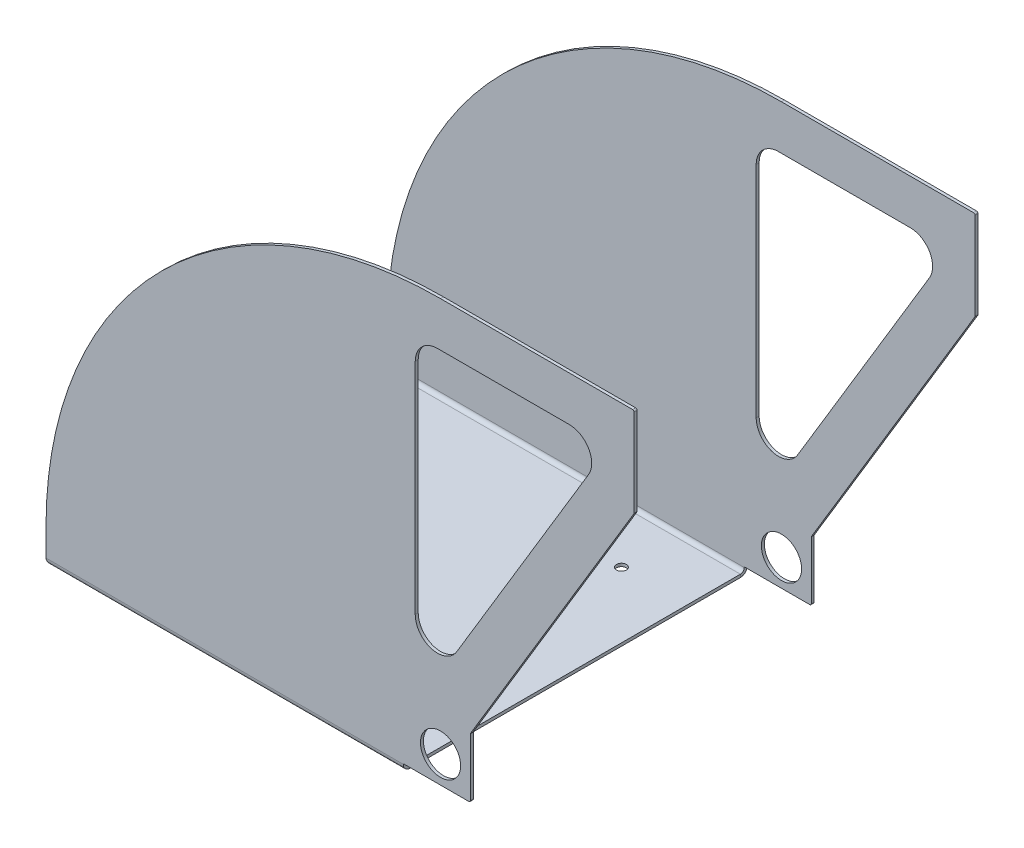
ISO-10303-21;
HEADER;
FILE_DESCRIPTION(('STEP AP214'),'2;1');
FILE_NAME('part.step','',(''),(''),'','','');
FILE_SCHEMA(('AUTOMOTIVE_DESIGN { 1 0 10303 214 1 1 1 1 }'));
ENDSEC;
DATA;
#1=APPLICATION_CONTEXT('core data for automotive mechanical design processes');
#2=APPLICATION_PROTOCOL_DEFINITION('international standard','automotive_design',2000,#1);
#3=PRODUCT_CONTEXT('',#1,'mechanical');
#4=PRODUCT('Part','Part','',(#3));
#5=PRODUCT_RELATED_PRODUCT_CATEGORY('part','',(#4));
#6=PRODUCT_DEFINITION_FORMATION('','',#4);
#7=PRODUCT_DEFINITION_CONTEXT('part definition',#1,'design');
#8=PRODUCT_DEFINITION('design','',#6,#7);
#9=PRODUCT_DEFINITION_SHAPE('','',#8);
#10=(LENGTH_UNIT() NAMED_UNIT(*) SI_UNIT(.MILLI.,.METRE.));
#11=(NAMED_UNIT(*) PLANE_ANGLE_UNIT() SI_UNIT($,.RADIAN.));
#12=(NAMED_UNIT(*) SI_UNIT($,.STERADIAN.) SOLID_ANGLE_UNIT());
#13=UNCERTAINTY_MEASURE_WITH_UNIT(LENGTH_MEASURE(1.E-05),#10,'distance_accuracy_value','');
#14=(GEOMETRIC_REPRESENTATION_CONTEXT(3) GLOBAL_UNCERTAINTY_ASSIGNED_CONTEXT((#13)) GLOBAL_UNIT_ASSIGNED_CONTEXT((#10,
#11,#12)) REPRESENTATION_CONTEXT('',''));
#15=CARTESIAN_POINT('',(0.,0.,0.));
#16=DIRECTION('',(0.,0.,1.));
#17=DIRECTION('',(1.,0.,0.));
#18=AXIS2_PLACEMENT_3D('',#15,#16,#17);
#19=CARTESIAN_POINT('',(-17.,72.7473757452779,231.));
#20=DIRECTION('',(1.,0.,0.));
#21=DIRECTION('',(0.,1.,0.));
#22=AXIS2_PLACEMENT_3D('',#19,#20,#21);
#23=PLANE('',#22);
#24=DIRECTION('',(0.,1.,0.));
#25=VECTOR('',#24,1.);
#26=CARTESIAN_POINT('',(-17.,72.7473757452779,2.));
#27=LINE('',#26,#25);
#28=CARTESIAN_POINT('',(-17.,72.7473757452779,2.));
#29=VERTEX_POINT('',#28);
#30=CARTESIAN_POINT('',(-17.,220.,2.00000000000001));
#31=VERTEX_POINT('',#30);
#32=EDGE_CURVE('E433',#29,#31,#27,.T.);
#33=ORIENTED_EDGE('',*,*,#32,.F.);
#34=DIRECTION('',(0.,0.,-1.));
#35=VECTOR('',#34,1.);
#36=CARTESIAN_POINT('',(-17.,72.7473757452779,231.));
#37=LINE('',#36,#35);
#38=CARTESIAN_POINT('',(-17.,72.7473757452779,0.));
#39=VERTEX_POINT('',#38);
#40=EDGE_CURVE('E568',#29,#39,#37,.T.);
#41=ORIENTED_EDGE('',*,*,#40,.T.);
#42=DIRECTION('',(0.,-1.,0.));
#43=VECTOR('',#42,1.);
#44=CARTESIAN_POINT('',(-17.,72.7473757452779,0.));
#45=LINE('',#44,#43);
#46=CARTESIAN_POINT('',(-17.,220.,0.));
#47=VERTEX_POINT('',#46);
#48=EDGE_CURVE('E443',#47,#39,#45,.T.);
#49=ORIENTED_EDGE('',*,*,#48,.F.);
#50=DIRECTION('',(0.,0.,-1.));
#51=VECTOR('',#50,1.);
#52=CARTESIAN_POINT('',(-17.,220.,231.));
#53=LINE('',#52,#51);
#54=EDGE_CURVE('E565',#31,#47,#53,.T.);
#55=ORIENTED_EDGE('',*,*,#54,.F.);
#56=EDGE_LOOP('',(#33,#41,#49,#55));
#57=FACE_BOUND('',#56,.T.);
#58=ADVANCED_FACE('F33',(#57),#23,.T.);
#59=CARTESIAN_POINT('',(-2.00000000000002,220.,231.));
#60=DIRECTION('',(0.,0.,-1.));
#61=DIRECTION('',(-1.,0.,0.));
#62=AXIS2_PLACEMENT_3D('',#59,#60,#61);
#63=CYLINDRICAL_SURFACE('',#62,15.);
#64=CARTESIAN_POINT('',(-2.00000000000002,220.,2.00000000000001));
#65=DIRECTION('',(0.,0.,-1.));
#66=DIRECTION('',(-1.,0.,0.));
#67=AXIS2_PLACEMENT_3D('',#64,#65,#66);
#68=CIRCLE('',#67,15.);
#69=CARTESIAN_POINT('',(-2.00000000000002,235.,2.00000000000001));
#70=VERTEX_POINT('',#69);
#71=EDGE_CURVE('E431',#31,#70,#68,.T.);
#72=ORIENTED_EDGE('',*,*,#71,.F.);
#73=ORIENTED_EDGE('',*,*,#54,.T.);
#74=CARTESIAN_POINT('',(-2.00000000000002,220.,0.));
#75=DIRECTION('',(0.,0.,1.));
#76=DIRECTION('',(-1.,0.,0.));
#77=AXIS2_PLACEMENT_3D('',#74,#75,#76);
#78=CIRCLE('',#77,15.);
#79=CARTESIAN_POINT('',(-2.00000000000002,235.,0.));
#80=VERTEX_POINT('',#79);
#81=EDGE_CURVE('E445',#80,#47,#78,.T.);
#82=ORIENTED_EDGE('',*,*,#81,.F.);
#83=DIRECTION('',(0.,0.,-1.));
#84=VECTOR('',#83,1.);
#85=CARTESIAN_POINT('',(-2.00000000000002,235.,231.));
#86=LINE('',#85,#84);
#87=EDGE_CURVE('E562',#70,#80,#86,.T.);
#88=ORIENTED_EDGE('',*,*,#87,.F.);
#89=EDGE_LOOP('',(#72,#73,#82,#88));
#90=FACE_BOUND('',#89,.T.);
#91=ADVANCED_FACE('F638',(#90),#63,.F.);
#92=CARTESIAN_POINT('',(-2.00000000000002,235.,231.));
#93=DIRECTION('',(0.,-1.,0.));
#94=DIRECTION('',(1.,0.,0.));
#95=AXIS2_PLACEMENT_3D('',#92,#93,#94);
#96=PLANE('',#95);
#97=DIRECTION('',(1.,0.,0.));
#98=VECTOR('',#97,1.);
#99=CARTESIAN_POINT('',(-2.00000000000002,235.,2.00000000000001));
#100=LINE('',#99,#98);
#101=CARTESIAN_POINT('',(86.5125063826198,235.,2.00000000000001));
#102=VERTEX_POINT('',#101);
#103=EDGE_CURVE('E429',#70,#102,#100,.T.);
#104=ORIENTED_EDGE('',*,*,#103,.F.);
#105=ORIENTED_EDGE('',*,*,#87,.T.);
#106=DIRECTION('',(-1.,0.,0.));
#107=VECTOR('',#106,1.);
#108=CARTESIAN_POINT('',(-2.00000000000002,235.,0.));
#109=LINE('',#108,#107);
#110=CARTESIAN_POINT('',(86.5125063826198,235.,0.));
#111=VERTEX_POINT('',#110);
#112=EDGE_CURVE('E447',#111,#80,#109,.T.);
#113=ORIENTED_EDGE('',*,*,#112,.F.);
#114=DIRECTION('',(0.,0.,-1.));
#115=VECTOR('',#114,1.);
#116=CARTESIAN_POINT('',(86.5125063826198,235.,231.));
#117=LINE('',#116,#115);
#118=EDGE_CURVE('E559',#102,#111,#117,.T.);
#119=ORIENTED_EDGE('',*,*,#118,.F.);
#120=EDGE_LOOP('',(#104,#105,#113,#119));
#121=FACE_BOUND('',#120,.T.);
#122=ADVANCED_FACE('F642',(#121),#96,.T.);
#123=CARTESIAN_POINT('',(86.5125063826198,220.,231.));
#124=DIRECTION('',(0.,0.,-1.));
#125=DIRECTION('',(-1.,0.,0.));
#126=AXIS2_PLACEMENT_3D('',#123,#124,#125);
#127=CYLINDRICAL_SURFACE('',#126,15.);
#128=CARTESIAN_POINT('',(86.5125063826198,220.,2.00000000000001));
#129=DIRECTION('',(0.,0.,-1.));
#130=DIRECTION('',(-1.,0.,0.));
#131=AXIS2_PLACEMENT_3D('',#128,#129,#130);
#132=CIRCLE('',#131,15.);
#133=CARTESIAN_POINT('',(99.3686973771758,212.272234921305,2.00000000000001));
#134=VERTEX_POINT('',#133);
#135=EDGE_CURVE('E427',#102,#134,#132,.T.);
#136=ORIENTED_EDGE('',*,*,#135,.F.);
#137=ORIENTED_EDGE('',*,*,#118,.T.);
#138=CARTESIAN_POINT('',(86.5125063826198,220.,0.));
#139=DIRECTION('',(0.,0.,1.));
#140=DIRECTION('',(1.,0.,0.));
#141=AXIS2_PLACEMENT_3D('',#138,#139,#140);
#142=CIRCLE('',#141,15.);
#143=CARTESIAN_POINT('',(99.3686973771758,212.272234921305,0.));
#144=VERTEX_POINT('',#143);
#145=EDGE_CURVE('E449',#144,#111,#142,.T.);
#146=ORIENTED_EDGE('',*,*,#145,.F.);
#147=DIRECTION('',(0.,0.,-1.));
#148=VECTOR('',#147,1.);
#149=CARTESIAN_POINT('',(99.3686973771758,212.272234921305,231.));
#150=LINE('',#149,#148);
#151=EDGE_CURVE('E556',#134,#144,#150,.T.);
#152=ORIENTED_EDGE('',*,*,#151,.F.);
#153=EDGE_LOOP('',(#136,#137,#146,#152));
#154=FACE_BOUND('',#153,.T.);
#155=ADVANCED_FACE('F646',(#154),#127,.F.);
#156=CARTESIAN_POINT('',(99.3686973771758,212.272234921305,231.));
#157=DIRECTION('',(-0.85707939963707,0.515184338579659,0.));
#158=DIRECTION('',(-0.515184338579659,-0.85707939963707,0.));
#159=AXIS2_PLACEMENT_3D('',#156,#157,#158);
#160=PLANE('',#159);
#161=DIRECTION('',(-0.515184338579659,-0.85707939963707,0.));
#162=VECTOR('',#161,1.);
#163=CARTESIAN_POINT('',(99.3686973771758,212.272234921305,2.00000000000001));
#164=LINE('',#163,#162);
#165=CARTESIAN_POINT('',(10.856190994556,65.0196106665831,2.00000000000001));
#166=VERTEX_POINT('',#165);
#167=EDGE_CURVE('E425',#134,#166,#164,.T.);
#168=ORIENTED_EDGE('',*,*,#167,.F.);
#169=ORIENTED_EDGE('',*,*,#151,.T.);
#170=DIRECTION('',(0.515184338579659,0.85707939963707,0.));
#171=VECTOR('',#170,1.);
#172=CARTESIAN_POINT('',(99.3686973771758,212.272234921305,0.));
#173=LINE('',#172,#171);
#174=CARTESIAN_POINT('',(10.856190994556,65.0196106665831,0.));
#175=VERTEX_POINT('',#174);
#176=EDGE_CURVE('E451',#175,#144,#173,.T.);
#177=ORIENTED_EDGE('',*,*,#176,.F.);
#178=DIRECTION('',(0.,0.,-1.));
#179=VECTOR('',#178,1.);
#180=CARTESIAN_POINT('',(10.856190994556,65.0196106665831,231.));
#181=LINE('',#180,#179);
#182=EDGE_CURVE('E554',#166,#175,#181,.T.);
#183=ORIENTED_EDGE('',*,*,#182,.F.);
#184=EDGE_LOOP('',(#168,#169,#177,#183));
#185=FACE_BOUND('',#184,.T.);
#186=ADVANCED_FACE('F650',(#185),#160,.T.);
#187=CARTESIAN_POINT('',(-1.99999999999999,72.7473757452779,231.));
#188=DIRECTION('',(0.,0.,-1.));
#189=DIRECTION('',(-1.,0.,0.));
#190=AXIS2_PLACEMENT_3D('',#187,#188,#189);
#191=CYLINDRICAL_SURFACE('',#190,15.);
#192=CARTESIAN_POINT('',(-1.99999999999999,72.7473757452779,2.));
#193=DIRECTION('',(0.,0.,-1.));
#194=DIRECTION('',(-1.,0.,0.));
#195=AXIS2_PLACEMENT_3D('',#192,#193,#194);
#196=CIRCLE('',#195,15.);
#197=EDGE_CURVE('E161',#166,#29,#196,.T.);
#198=ORIENTED_EDGE('',*,*,#197,.F.);
#199=ORIENTED_EDGE('',*,*,#182,.T.);
#200=CARTESIAN_POINT('',(-1.99999999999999,72.7473757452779,0.));
#201=DIRECTION('',(0.,0.,1.));
#202=DIRECTION('',(-1.,0.,0.));
#203=AXIS2_PLACEMENT_3D('',#200,#201,#202);
#204=CIRCLE('',#203,15.);
#205=EDGE_CURVE('E157',#39,#175,#204,.T.);
#206=ORIENTED_EDGE('',*,*,#205,.F.);
#207=ORIENTED_EDGE('',*,*,#40,.F.);
#208=EDGE_LOOP('',(#198,#199,#206,#207));
#209=FACE_BOUND('',#208,.T.);
#210=ADVANCED_FACE('F654',(#209),#191,.F.);
#211=CARTESIAN_POINT('',(19.,-17.,974.304398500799));
#212=DIRECTION('',(0.,0.,-1.));
#213=DIRECTION('',(0.,1.,0.));
#214=AXIS2_PLACEMENT_3D('',#211,#212,#213);
#215=CYLINDRICAL_SURFACE('',#214,1.);
#216=CARTESIAN_POINT('',(19.,-17.,0.));
#217=DIRECTION('',(0.,0.,1.));
#218=DIRECTION('',(-1.,0.,0.));
#219=AXIS2_PLACEMENT_3D('',#216,#217,#218);
#220=CIRCLE('',#219,1.);
#221=CARTESIAN_POINT('',(19.,-18.,0.));
#222=VERTEX_POINT('',#221);
#223=CARTESIAN_POINT('',(20.,-17.,0.));
#224=VERTEX_POINT('',#223);
#225=EDGE_CURVE('E551',#222,#224,#220,.T.);
#226=ORIENTED_EDGE('',*,*,#225,.T.);
#227=DIRECTION('',(0.,0.,-1.));
#228=VECTOR('',#227,1.);
#229=CARTESIAN_POINT('',(20.,-17.,974.304398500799));
#230=LINE('',#229,#228);
#231=CARTESIAN_POINT('',(20.,-17.,2.00000000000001));
#232=VERTEX_POINT('',#231);
#233=EDGE_CURVE('E536',#232,#224,#230,.T.);
#234=ORIENTED_EDGE('',*,*,#233,.F.);
#235=CARTESIAN_POINT('',(19.,-17.,2.00000000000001));
#236=DIRECTION('',(0.,0.,-1.));
#237=DIRECTION('',(-1.,0.,0.));
#238=AXIS2_PLACEMENT_3D('',#235,#236,#237);
#239=CIRCLE('',#238,1.);
#240=CARTESIAN_POINT('',(19.,-18.,2.00000000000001));
#241=VERTEX_POINT('',#240);
#242=EDGE_CURVE('E548',#232,#241,#239,.T.);
#243=ORIENTED_EDGE('',*,*,#242,.T.);
#244=DIRECTION('',(0.,0.,-1.));
#245=VECTOR('',#244,1.);
#246=CARTESIAN_POINT('',(19.,-18.,974.304398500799));
#247=LINE('',#246,#245);
#248=EDGE_CURVE('E545',#241,#222,#247,.T.);
#249=ORIENTED_EDGE('',*,*,#248,.T.);
#250=EDGE_LOOP('',(#226,#234,#243,#249));
#251=FACE_BOUND('',#250,.T.);
#252=ADVANCED_FACE('F658',(#251),#215,.T.);
#253=CARTESIAN_POINT('',(20.,-17.,974.304398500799));
#254=DIRECTION('',(1.,0.,0.));
#255=DIRECTION('',(0.,1.,0.));
#256=AXIS2_PLACEMENT_3D('',#253,#254,#255);
#257=PLANE('',#256);
#258=DIRECTION('',(0.,1.,0.));
#259=VECTOR('',#258,1.);
#260=CARTESIAN_POINT('',(20.,-17.,0.));
#261=LINE('',#260,#259);
#262=CARTESIAN_POINT('',(20.,21.7225835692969,0.));
#263=VERTEX_POINT('',#262);
#264=EDGE_CURVE('E542',#224,#263,#261,.T.);
#265=ORIENTED_EDGE('',*,*,#264,.T.);
#266=DIRECTION('',(0.,0.,-1.));
#267=VECTOR('',#266,1.);
#268=CARTESIAN_POINT('',(20.,21.7225835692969,974.304398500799));
#269=LINE('',#268,#267);
#270=CARTESIAN_POINT('',(20.,21.7225835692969,2.));
#271=VERTEX_POINT('',#270);
#272=EDGE_CURVE('E527',#271,#263,#269,.T.);
#273=ORIENTED_EDGE('',*,*,#272,.F.);
#274=DIRECTION('',(0.,-1.,0.));
#275=VECTOR('',#274,1.);
#276=CARTESIAN_POINT('',(20.,-17.,2.00000000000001));
#277=LINE('',#276,#275);
#278=EDGE_CURVE('E539',#271,#232,#277,.T.);
#279=ORIENTED_EDGE('',*,*,#278,.T.);
#280=ORIENTED_EDGE('',*,*,#233,.T.);
#281=EDGE_LOOP('',(#265,#273,#279,#280));
#282=FACE_BOUND('',#281,.T.);
#283=ADVANCED_FACE('F661',(#282),#257,.T.);
#284=CARTESIAN_POINT('',(21.,21.7225835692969,974.304398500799));
#285=DIRECTION('',(0.,0.,-1.));
#286=DIRECTION('',(0.,1.,0.));
#287=AXIS2_PLACEMENT_3D('',#284,#285,#286);
#288=CYLINDRICAL_SURFACE('',#287,0.999999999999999);
#289=CARTESIAN_POINT('',(21.,21.7225835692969,0.));
#290=DIRECTION('',(0.,0.,-1.));
#291=DIRECTION('',(-1.,0.,0.));
#292=AXIS2_PLACEMENT_3D('',#289,#290,#291);
#293=CIRCLE('',#292,0.999999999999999);
#294=CARTESIAN_POINT('',(20.1429206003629,22.2377679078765,0.));
#295=VERTEX_POINT('',#294);
#296=EDGE_CURVE('E533',#263,#295,#293,.T.);
#297=ORIENTED_EDGE('',*,*,#296,.T.);
#298=DIRECTION('',(0.,0.,-1.));
#299=VECTOR('',#298,1.);
#300=CARTESIAN_POINT('',(20.1429206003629,22.2377679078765,974.304398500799));
#301=LINE('',#300,#299);
#302=CARTESIAN_POINT('',(20.1429206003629,22.2377679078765,2.));
#303=VERTEX_POINT('',#302);
#304=EDGE_CURVE('E518',#303,#295,#301,.T.);
#305=ORIENTED_EDGE('',*,*,#304,.F.);
#306=CARTESIAN_POINT('',(21.,21.7225835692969,2.));
#307=DIRECTION('',(0.,0.,-1.));
#308=DIRECTION('',(-1.,0.,0.));
#309=AXIS2_PLACEMENT_3D('',#306,#307,#308);
#310=CIRCLE('',#309,0.999999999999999);
#311=EDGE_CURVE('E530',#303,#271,#310,.F.);
#312=ORIENTED_EDGE('',*,*,#311,.T.);
#313=ORIENTED_EDGE('',*,*,#272,.T.);
#314=EDGE_LOOP('',(#297,#305,#312,#313));
#315=FACE_BOUND('',#314,.T.);
#316=ADVANCED_FACE('F665',(#315),#288,.F.);
#317=CARTESIAN_POINT('',(20.1429206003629,22.2377679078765,974.304398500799));
#318=DIRECTION('',(0.85707939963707,-0.515184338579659,0.));
#319=DIRECTION('',(0.515184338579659,0.85707939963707,0.));
#320=AXIS2_PLACEMENT_3D('',#317,#318,#319);
#321=PLANE('',#320);
#322=DIRECTION('',(0.515184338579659,0.85707939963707,0.));
#323=VECTOR('',#322,1.);
#324=CARTESIAN_POINT('',(20.1429206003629,22.2377679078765,0.));
#325=LINE('',#324,#323);
#326=CARTESIAN_POINT('',(129.857079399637,204.762232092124,0.));
#327=VERTEX_POINT('',#326);
#328=EDGE_CURVE('E524',#295,#327,#325,.T.);
#329=ORIENTED_EDGE('',*,*,#328,.T.);
#330=DIRECTION('',(0.,0.,-1.));
#331=VECTOR('',#330,1.);
#332=CARTESIAN_POINT('',(129.857079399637,204.762232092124,974.304398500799));
#333=LINE('',#332,#331);
#334=CARTESIAN_POINT('',(129.857079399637,204.762232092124,2.00000000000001));
#335=VERTEX_POINT('',#334);
#336=EDGE_CURVE('E509',#335,#327,#333,.T.);
#337=ORIENTED_EDGE('',*,*,#336,.F.);
#338=DIRECTION('',(-0.515184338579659,-0.85707939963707,0.));
#339=VECTOR('',#338,1.);
#340=CARTESIAN_POINT('',(20.1429206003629,22.2377679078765,2.));
#341=LINE('',#340,#339);
#342=EDGE_CURVE('E521',#335,#303,#341,.T.);
#343=ORIENTED_EDGE('',*,*,#342,.T.);
#344=ORIENTED_EDGE('',*,*,#304,.T.);
#345=EDGE_LOOP('',(#329,#337,#343,#344));
#346=FACE_BOUND('',#345,.T.);
#347=ADVANCED_FACE('F669',(#346),#321,.T.);
#348=CARTESIAN_POINT('',(129.,205.277416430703,974.304398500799));
#349=DIRECTION('',(0.,0.,-1.));
#350=DIRECTION('',(0.,1.,0.));
#351=AXIS2_PLACEMENT_3D('',#348,#349,#350);
#352=CYLINDRICAL_SURFACE('',#351,0.99999999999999);
#353=CARTESIAN_POINT('',(129.,205.277416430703,0.));
#354=DIRECTION('',(0.,0.,1.));
#355=DIRECTION('',(-1.,0.,0.));
#356=AXIS2_PLACEMENT_3D('',#353,#354,#355);
#357=CIRCLE('',#356,0.99999999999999);
#358=CARTESIAN_POINT('',(130.,205.277416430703,0.));
#359=VERTEX_POINT('',#358);
#360=EDGE_CURVE('E515',#327,#359,#357,.T.);
#361=ORIENTED_EDGE('',*,*,#360,.T.);
#362=DIRECTION('',(0.,0.,-1.));
#363=VECTOR('',#362,1.);
#364=CARTESIAN_POINT('',(130.,205.277416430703,974.304398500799));
#365=LINE('',#364,#363);
#366=CARTESIAN_POINT('',(130.,205.277416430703,2.));
#367=VERTEX_POINT('',#366);
#368=EDGE_CURVE('E500',#367,#359,#365,.T.);
#369=ORIENTED_EDGE('',*,*,#368,.F.);
#370=CARTESIAN_POINT('',(129.,205.277416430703,2.00000000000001));
#371=DIRECTION('',(0.,0.,-1.));
#372=DIRECTION('',(-1.,0.,0.));
#373=AXIS2_PLACEMENT_3D('',#370,#371,#372);
#374=CIRCLE('',#373,0.99999999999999);
#375=EDGE_CURVE('E512',#367,#335,#374,.T.);
#376=ORIENTED_EDGE('',*,*,#375,.T.);
#377=ORIENTED_EDGE('',*,*,#336,.T.);
#378=EDGE_LOOP('',(#361,#369,#376,#377));
#379=FACE_BOUND('',#378,.T.);
#380=ADVANCED_FACE('F673',(#379),#352,.T.);
#381=CARTESIAN_POINT('',(130.,-21.,974.304398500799));
#382=DIRECTION('',(1.,0.,0.));
#383=DIRECTION('',(0.,1.,0.));
#384=AXIS2_PLACEMENT_3D('',#381,#382,#383);
#385=PLANE('',#384);
#386=DIRECTION('',(0.,1.,0.));
#387=VECTOR('',#386,1.);
#388=CARTESIAN_POINT('',(130.,264.,0.));
#389=LINE('',#388,#387);
#390=CARTESIAN_POINT('',(130.,264.,0.));
#391=VERTEX_POINT('',#390);
#392=EDGE_CURVE('E506',#359,#391,#389,.T.);
#393=ORIENTED_EDGE('',*,*,#392,.T.);
#394=DIRECTION('',(0.,0.,-1.));
#395=VECTOR('',#394,1.);
#396=CARTESIAN_POINT('',(130.,264.,974.304398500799));
#397=LINE('',#396,#395);
#398=CARTESIAN_POINT('',(130.,264.,2.));
#399=VERTEX_POINT('',#398);
#400=EDGE_CURVE('E491',#399,#391,#397,.T.);
#401=ORIENTED_EDGE('',*,*,#400,.F.);
#402=DIRECTION('',(0.,-1.,0.));
#403=VECTOR('',#402,1.);
#404=CARTESIAN_POINT('',(130.,-21.,2.));
#405=LINE('',#404,#403);
#406=EDGE_CURVE('E503',#399,#367,#405,.T.);
#407=ORIENTED_EDGE('',*,*,#406,.T.);
#408=ORIENTED_EDGE('',*,*,#368,.T.);
#409=EDGE_LOOP('',(#393,#401,#407,#408));
#410=FACE_BOUND('',#409,.T.);
#411=ADVANCED_FACE('F677',(#410),#385,.T.);
#412=CARTESIAN_POINT('',(129.,264.,974.304398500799));
#413=DIRECTION('',(0.,0.,-1.));
#414=DIRECTION('',(0.,1.,0.));
#415=AXIS2_PLACEMENT_3D('',#412,#413,#414);
#416=CYLINDRICAL_SURFACE('',#415,1.00000000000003);
#417=CARTESIAN_POINT('',(129.,264.,0.));
#418=DIRECTION('',(0.,0.,1.));
#419=DIRECTION('',(1.,0.,0.));
#420=AXIS2_PLACEMENT_3D('',#417,#418,#419);
#421=CIRCLE('',#420,1.00000000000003);
#422=CARTESIAN_POINT('',(129.,265.,0.));
#423=VERTEX_POINT('',#422);
#424=EDGE_CURVE('E497',#391,#423,#421,.T.);
#425=ORIENTED_EDGE('',*,*,#424,.T.);
#426=DIRECTION('',(0.,0.,-1.));
#427=VECTOR('',#426,1.);
#428=CARTESIAN_POINT('',(129.,265.,974.304398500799));
#429=LINE('',#428,#427);
#430=CARTESIAN_POINT('',(129.,265.,2.00000000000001));
#431=VERTEX_POINT('',#430);
#432=EDGE_CURVE('E482',#431,#423,#429,.T.);
#433=ORIENTED_EDGE('',*,*,#432,.F.);
#434=CARTESIAN_POINT('',(129.,264.,2.00000000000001));
#435=DIRECTION('',(0.,0.,-1.));
#436=DIRECTION('',(-1.,0.,0.));
#437=AXIS2_PLACEMENT_3D('',#434,#435,#436);
#438=CIRCLE('',#437,1.00000000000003);
#439=EDGE_CURVE('E494',#431,#399,#438,.T.);
#440=ORIENTED_EDGE('',*,*,#439,.T.);
#441=ORIENTED_EDGE('',*,*,#400,.T.);
#442=EDGE_LOOP('',(#425,#433,#440,#441));
#443=FACE_BOUND('',#442,.T.);
#444=ADVANCED_FACE('F681',(#443),#416,.T.);
#445=CARTESIAN_POINT('',(0.,265.,974.304398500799));
#446=DIRECTION('',(0.,1.,0.));
#447=DIRECTION('',(-1.,0.,0.));
#448=AXIS2_PLACEMENT_3D('',#445,#446,#447);
#449=PLANE('',#448);
#450=DIRECTION('',(-1.,0.,0.));
#451=VECTOR('',#450,1.);
#452=CARTESIAN_POINT('',(0.,265.,0.));
#453=LINE('',#452,#451);
#454=CARTESIAN_POINT('',(0.,265.,0.));
#455=VERTEX_POINT('',#454);
#456=EDGE_CURVE('E488',#423,#455,#453,.T.);
#457=ORIENTED_EDGE('',*,*,#456,.T.);
#458=DIRECTION('',(0.,0.,-1.));
#459=VECTOR('',#458,1.);
#460=CARTESIAN_POINT('',(0.,265.,974.304398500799));
#461=LINE('',#460,#459);
#462=CARTESIAN_POINT('',(0.,265.,2.00000000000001));
#463=VERTEX_POINT('',#462);
#464=EDGE_CURVE('E475',#463,#455,#461,.T.);
#465=ORIENTED_EDGE('',*,*,#464,.F.);
#466=DIRECTION('',(1.,0.,0.));
#467=VECTOR('',#466,1.);
#468=CARTESIAN_POINT('',(0.,265.,2.00000000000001));
#469=LINE('',#468,#467);
#470=EDGE_CURVE('E485',#463,#431,#469,.T.);
#471=ORIENTED_EDGE('',*,*,#470,.T.);
#472=ORIENTED_EDGE('',*,*,#432,.T.);
#473=EDGE_LOOP('',(#457,#465,#471,#472));
#474=FACE_BOUND('',#473,.T.);
#475=ADVANCED_FACE('F685',(#474),#449,.T.);
#476=CARTESIAN_POINT('',(0.,0.,974.304398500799));
#477=DIRECTION('',(0.,0.,-1.));
#478=DIRECTION('',(0.,1.,0.));
#479=AXIS2_PLACEMENT_3D('',#476,#477,#478);
#480=CYLINDRICAL_SURFACE('',#479,265.);
#481=CARTESIAN_POINT('',(0.,0.,0.));
#482=DIRECTION('',(0.,0.,1.));
#483=DIRECTION('',(1.,0.,0.));
#484=AXIS2_PLACEMENT_3D('',#481,#482,#483);
#485=CIRCLE('',#484,265.);
#486=CARTESIAN_POINT('',(-265.,0.,0.));
#487=VERTEX_POINT('',#486);
#488=EDGE_CURVE('E479',#455,#487,#485,.T.);
#489=ORIENTED_EDGE('',*,*,#488,.T.);
#490=DIRECTION('',(0.,0.,-1.));
#491=VECTOR('',#490,1.);
#492=CARTESIAN_POINT('',(-265.,0.,974.304398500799));
#493=LINE('',#492,#491);
#494=CARTESIAN_POINT('',(-265.,0.,1.99999999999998));
#495=VERTEX_POINT('',#494);
#496=EDGE_CURVE('E440',#495,#487,#493,.T.);
#497=ORIENTED_EDGE('',*,*,#496,.F.);
#498=CARTESIAN_POINT('',(0.,0.,2.00000000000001));
#499=DIRECTION('',(0.,0.,-1.));
#500=DIRECTION('',(-1.,0.,0.));
#501=AXIS2_PLACEMENT_3D('',#498,#499,#500);
#502=CIRCLE('',#501,265.);
#503=EDGE_CURVE('E53',#495,#463,#502,.T.);
#504=ORIENTED_EDGE('',*,*,#503,.T.);
#505=ORIENTED_EDGE('',*,*,#464,.T.);
#506=EDGE_LOOP('',(#489,#497,#504,#505));
#507=FACE_BOUND('',#506,.T.);
#508=ADVANCED_FACE('F689',(#507),#480,.T.);
#509=CARTESIAN_POINT('',(0.,0.,231.));
#510=DIRECTION('',(0.,0.,-1.));
#511=DIRECTION('',(-1.,0.,0.));
#512=AXIS2_PLACEMENT_3D('',#509,#510,#511);
#513=CYLINDRICAL_SURFACE('',#512,13.5);
#514=CARTESIAN_POINT('',(0.,0.,2.00000000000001));
#515=DIRECTION('',(0.,0.,-1.));
#516=DIRECTION('',(-1.,0.,0.));
#517=AXIS2_PLACEMENT_3D('',#514,#515,#516);
#518=CIRCLE('',#517,13.5);
#519=CARTESIAN_POINT('',(-13.5,0.,2.00000000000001));
#520=VERTEX_POINT('',#519);
#521=EDGE_CURVE('E436',#520,#520,#518,.T.);
#522=ORIENTED_EDGE('',*,*,#521,.F.);
#523=EDGE_LOOP('',(#522));
#524=FACE_BOUND('',#523,.T.);
#525=CARTESIAN_POINT('',(0.,0.,0.));
#526=DIRECTION('',(0.,0.,1.));
#527=DIRECTION('',(1.,0.,0.));
#528=AXIS2_PLACEMENT_3D('',#525,#526,#527);
#529=CIRCLE('',#528,13.5);
#530=CARTESIAN_POINT('',(13.5,0.,0.));
#531=VERTEX_POINT('',#530);
#532=EDGE_CURVE('E454',#531,#531,#529,.T.);
#533=ORIENTED_EDGE('',*,*,#532,.F.);
#534=EDGE_LOOP('',(#533));
#535=FACE_BOUND('',#534,.T.);
#536=ADVANCED_FACE('F693',(#524,#535),#513,.F.);
#537=CARTESIAN_POINT('',(19.,-18.,974.304398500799));
#538=DIRECTION('',(0.,-1.,0.));
#539=DIRECTION('',(1.,0.,0.));
#540=AXIS2_PLACEMENT_3D('',#537,#538,#539);
#541=PLANE('',#540);
#542=DIRECTION('',(1.,0.,0.));
#543=VECTOR('',#542,1.);
#544=CARTESIAN_POINT('',(19.,-18.,0.));
#545=LINE('',#544,#543);
#546=CARTESIAN_POINT('',(-25.,-18.,0.));
#547=VERTEX_POINT('',#546);
#548=EDGE_CURVE('E472',#547,#222,#545,.T.);
#549=ORIENTED_EDGE('',*,*,#548,.T.);
#550=ORIENTED_EDGE('',*,*,#248,.F.);
#551=DIRECTION('',(-1.,0.,0.));
#552=VECTOR('',#551,1.);
#553=CARTESIAN_POINT('',(19.,-18.,2.00000000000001));
#554=LINE('',#553,#552);
#555=CARTESIAN_POINT('',(-25.,-18.,2.00000000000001));
#556=VERTEX_POINT('',#555);
#557=EDGE_CURVE('E469',#241,#556,#554,.T.);
#558=ORIENTED_EDGE('',*,*,#557,.T.);
#559=DIRECTION('',(0.,0.,-1.));
#560=VECTOR('',#559,1.);
#561=CARTESIAN_POINT('',(-25.,-18.,974.304398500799));
#562=LINE('',#561,#560);
#563=EDGE_CURVE('E466',#556,#547,#562,.T.);
#564=ORIENTED_EDGE('',*,*,#563,.T.);
#565=EDGE_LOOP('',(#549,#550,#558,#564));
#566=FACE_BOUND('',#565,.T.);
#567=ADVANCED_FACE('F697',(#566),#541,.T.);
#568=CARTESIAN_POINT('',(-25.,-23.,974.304398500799));
#569=DIRECTION('',(1.,0.,0.));
#570=DIRECTION('',(0.,1.,0.));
#571=AXIS2_PLACEMENT_3D('',#568,#569,#570);
#572=PLANE('',#571);
#573=DIRECTION('',(0.,1.,0.));
#574=VECTOR('',#573,1.);
#575=CARTESIAN_POINT('',(-25.,-23.,0.));
#576=LINE('',#575,#574);
#577=CARTESIAN_POINT('',(-25.,-18.4060000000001,0.));
#578=VERTEX_POINT('',#577);
#579=EDGE_CURVE('E463',#578,#547,#576,.T.);
#580=ORIENTED_EDGE('',*,*,#579,.T.);
#581=ORIENTED_EDGE('',*,*,#563,.F.);
#582=DIRECTION('',(0.,-1.,0.));
#583=VECTOR('',#582,1.);
#584=CARTESIAN_POINT('',(-25.,-23.,2.00000000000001));
#585=LINE('',#584,#583);
#586=CARTESIAN_POINT('',(-25.,-18.406,2.));
#587=VERTEX_POINT('',#586);
#588=EDGE_CURVE('E460',#556,#587,#585,.T.);
#589=ORIENTED_EDGE('',*,*,#588,.T.);
#590=DIRECTION('',(0.,0.,-1.));
#591=VECTOR('',#590,1.);
#592=CARTESIAN_POINT('',(-25.,-18.406,974.304398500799));
#593=LINE('',#592,#591);
#594=EDGE_CURVE('E457',#587,#578,#593,.T.);
#595=ORIENTED_EDGE('',*,*,#594,.T.);
#596=EDGE_LOOP('',(#580,#581,#589,#595));
#597=FACE_BOUND('',#596,.T.);
#598=ADVANCED_FACE('F701',(#597),#572,.T.);
#599=CARTESIAN_POINT('',(0.,0.,0.));
#600=DIRECTION('',(0.,0.,1.));
#601=DIRECTION('',(1.,0.,0.));
#602=AXIS2_PLACEMENT_3D('',#599,#600,#601);
#603=PLANE('',#602);
#604=ORIENTED_EDGE('',*,*,#532,.T.);
#605=EDGE_LOOP('',(#604));
#606=FACE_BOUND('',#605,.T.);
#607=ORIENTED_EDGE('',*,*,#579,.F.);
#608=DIRECTION('',(-1.,0.,0.));
#609=VECTOR('',#608,1.);
#610=CARTESIAN_POINT('',(-25.,-18.406,0.));
#611=LINE('',#610,#609);
#612=CARTESIAN_POINT('',(-265.,-18.406,0.));
#613=VERTEX_POINT('',#612);
#614=EDGE_CURVE('E351',#578,#613,#611,.T.);
#615=ORIENTED_EDGE('',*,*,#614,.T.);
#616=DIRECTION('',(0.,-1.,0.));
#617=VECTOR('',#616,1.);
#618=CARTESIAN_POINT('',(-265.,0.,0.));
#619=LINE('',#618,#617);
#620=EDGE_CURVE('E439',#487,#613,#619,.T.);
#621=ORIENTED_EDGE('',*,*,#620,.F.);
#622=ORIENTED_EDGE('',*,*,#488,.F.);
#623=ORIENTED_EDGE('',*,*,#456,.F.);
#624=ORIENTED_EDGE('',*,*,#424,.F.);
#625=ORIENTED_EDGE('',*,*,#392,.F.);
#626=ORIENTED_EDGE('',*,*,#360,.F.);
#627=ORIENTED_EDGE('',*,*,#328,.F.);
#628=ORIENTED_EDGE('',*,*,#296,.F.);
#629=ORIENTED_EDGE('',*,*,#264,.F.);
#630=ORIENTED_EDGE('',*,*,#225,.F.);
#631=ORIENTED_EDGE('',*,*,#548,.F.);
#632=EDGE_LOOP('',(#607,#615,#621,#622,#623,#624,#625,#626,#627,#628,#629,#630,#631));
#633=FACE_BOUND('',#632,.T.);
#634=ORIENTED_EDGE('',*,*,#205,.T.);
#635=ORIENTED_EDGE('',*,*,#176,.T.);
#636=ORIENTED_EDGE('',*,*,#145,.T.);
#637=ORIENTED_EDGE('',*,*,#112,.T.);
#638=ORIENTED_EDGE('',*,*,#81,.T.);
#639=ORIENTED_EDGE('',*,*,#48,.T.);
#640=EDGE_LOOP('',(#634,#635,#636,#637,#638,#639));
#641=FACE_BOUND('',#640,.T.);
#642=ADVANCED_FACE('F705',(#606,#633,#641),#603,.F.);
#643=CARTESIAN_POINT('',(-265.,-21.,974.304398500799));
#644=DIRECTION('',(1.,0.,0.));
#645=DIRECTION('',(0.,1.,0.));
#646=AXIS2_PLACEMENT_3D('',#643,#644,#645);
#647=PLANE('',#646);
#648=ORIENTED_EDGE('',*,*,#496,.T.);
#649=ORIENTED_EDGE('',*,*,#620,.T.);
#650=CARTESIAN_POINT('',(-265.,-18.406,2.));
#651=CARTESIAN_POINT('',(-265.,-18.4060000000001,0.));
#652=B_SPLINE_CURVE_WITH_KNOTS('',1,(#650,#651),.UNSPECIFIED.,.F.,.F.,(2,2),(0.,1.),.UNSPECIFIED.);
#653=CARTESIAN_POINT('',(-265.,-18.406,2.));
#654=VERTEX_POINT('',#653);
#655=EDGE_CURVE('E571',#654,#613,#652,.T.);
#656=ORIENTED_EDGE('',*,*,#655,.F.);
#657=DIRECTION('',(0.,-1.,0.));
#658=VECTOR('',#657,1.);
#659=CARTESIAN_POINT('',(-265.,-21.,2.));
#660=LINE('',#659,#658);
#661=EDGE_CURVE('E44',#495,#654,#660,.T.);
#662=ORIENTED_EDGE('',*,*,#661,.F.);
#663=EDGE_LOOP('',(#648,#649,#656,#662));
#664=FACE_BOUND('',#663,.T.);
#665=ADVANCED_FACE('F586',(#664),#647,.F.);
#666=CARTESIAN_POINT('',(130.,-21.,2.));
#667=DIRECTION('',(0.,0.,-1.));
#668=DIRECTION('',(-1.,0.,0.));
#669=AXIS2_PLACEMENT_3D('',#666,#667,#668);
#670=PLANE('',#669);
#671=ORIENTED_EDGE('',*,*,#521,.T.);
#672=EDGE_LOOP('',(#671));
#673=FACE_BOUND('',#672,.T.);
#674=ORIENTED_EDGE('',*,*,#197,.T.);
#675=ORIENTED_EDGE('',*,*,#32,.T.);
#676=ORIENTED_EDGE('',*,*,#71,.T.);
#677=ORIENTED_EDGE('',*,*,#103,.T.);
#678=ORIENTED_EDGE('',*,*,#135,.T.);
#679=ORIENTED_EDGE('',*,*,#167,.T.);
#680=EDGE_LOOP('',(#674,#675,#676,#677,#678,#679));
#681=FACE_BOUND('',#680,.T.);
#682=ORIENTED_EDGE('',*,*,#661,.T.);
#683=DIRECTION('',(1.,0.,0.));
#684=VECTOR('',#683,1.);
#685=CARTESIAN_POINT('',(-25.,-18.406,1.99999999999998));
#686=LINE('',#685,#684);
#687=EDGE_CURVE('E11',#654,#587,#686,.T.);
#688=ORIENTED_EDGE('',*,*,#687,.T.);
#689=ORIENTED_EDGE('',*,*,#588,.F.);
#690=ORIENTED_EDGE('',*,*,#557,.F.);
#691=ORIENTED_EDGE('',*,*,#242,.F.);
#692=ORIENTED_EDGE('',*,*,#278,.F.);
#693=ORIENTED_EDGE('',*,*,#311,.F.);
#694=ORIENTED_EDGE('',*,*,#342,.F.);
#695=ORIENTED_EDGE('',*,*,#375,.F.);
#696=ORIENTED_EDGE('',*,*,#406,.F.);
#697=ORIENTED_EDGE('',*,*,#439,.F.);
#698=ORIENTED_EDGE('',*,*,#470,.F.);
#699=ORIENTED_EDGE('',*,*,#503,.F.);
#700=EDGE_LOOP('',(#682,#688,#689,#690,#691,#692,#693,#694,#695,#696,#697,#698,#699));
#701=FACE_BOUND('',#700,.T.);
#702=ADVANCED_FACE('F35',(#673,#681,#701),#670,.F.);
#703=CARTESIAN_POINT('',(86.5125063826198,220.,231.));
#704=DIRECTION('',(0.,0.,-1.));
#705=DIRECTION('',(-1.,0.,0.));
#706=AXIS2_PLACEMENT_3D('',#703,#704,#705);
#707=CYLINDRICAL_SURFACE('',#706,15.);
#708=CARTESIAN_POINT('',(86.5125063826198,220.,229.));
#709=DIRECTION('',(0.,0.,1.));
#710=DIRECTION('',(1.,0.,0.));
#711=AXIS2_PLACEMENT_3D('',#708,#709,#710);
#712=CIRCLE('',#711,15.);
#713=CARTESIAN_POINT('',(99.3686973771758,212.272234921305,229.));
#714=VERTEX_POINT('',#713);
#715=CARTESIAN_POINT('',(86.5125063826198,235.,229.));
#716=VERTEX_POINT('',#715);
#717=EDGE_CURVE('E1083',#714,#716,#712,.T.);
#718=ORIENTED_EDGE('',*,*,#717,.F.);
#719=DIRECTION('',(0.,0.,-1.));
#720=VECTOR('',#719,1.);
#721=CARTESIAN_POINT('',(99.3686973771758,212.272234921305,231.));
#722=LINE('',#721,#720);
#723=CARTESIAN_POINT('',(99.3686973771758,212.272234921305,231.));
#724=VERTEX_POINT('',#723);
#725=EDGE_CURVE('E997',#724,#714,#722,.T.);
#726=ORIENTED_EDGE('',*,*,#725,.F.);
#727=CARTESIAN_POINT('',(86.5125063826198,220.,231.));
#728=DIRECTION('',(0.,0.,1.));
#729=DIRECTION('',(1.,0.,0.));
#730=AXIS2_PLACEMENT_3D('',#727,#728,#729);
#731=CIRCLE('',#730,15.);
#732=CARTESIAN_POINT('',(86.5125063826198,235.,231.));
#733=VERTEX_POINT('',#732);
#734=EDGE_CURVE('E957',#724,#733,#731,.T.);
#735=ORIENTED_EDGE('',*,*,#734,.T.);
#736=DIRECTION('',(0.,0.,-1.));
#737=VECTOR('',#736,1.);
#738=CARTESIAN_POINT('',(86.5125063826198,235.,231.));
#739=LINE('',#738,#737);
#740=EDGE_CURVE('E959',#733,#716,#739,.T.);
#741=ORIENTED_EDGE('',*,*,#740,.T.);
#742=EDGE_LOOP('',(#718,#726,#735,#741));
#743=FACE_BOUND('',#742,.T.);
#744=ADVANCED_FACE('F714',(#743),#707,.F.);
#745=CARTESIAN_POINT('',(-2.00000000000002,235.,231.));
#746=DIRECTION('',(0.,-1.,0.));
#747=DIRECTION('',(1.,0.,0.));
#748=AXIS2_PLACEMENT_3D('',#745,#746,#747);
#749=PLANE('',#748);
#750=DIRECTION('',(-1.,0.,0.));
#751=VECTOR('',#750,1.);
#752=CARTESIAN_POINT('',(-2.00000000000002,235.,229.));
#753=LINE('',#752,#751);
#754=CARTESIAN_POINT('',(-2.00000000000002,235.,229.));
#755=VERTEX_POINT('',#754);
#756=EDGE_CURVE('E1085',#716,#755,#753,.T.);
#757=ORIENTED_EDGE('',*,*,#756,.F.);
#758=ORIENTED_EDGE('',*,*,#740,.F.);
#759=DIRECTION('',(-1.,0.,0.));
#760=VECTOR('',#759,1.);
#761=CARTESIAN_POINT('',(-2.00000000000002,235.,231.));
#762=LINE('',#761,#760);
#763=CARTESIAN_POINT('',(-2.00000000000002,235.,231.));
#764=VERTEX_POINT('',#763);
#765=EDGE_CURVE('E971',#733,#764,#762,.T.);
#766=ORIENTED_EDGE('',*,*,#765,.T.);
#767=DIRECTION('',(0.,0.,-1.));
#768=VECTOR('',#767,1.);
#769=CARTESIAN_POINT('',(-2.00000000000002,235.,231.));
#770=LINE('',#769,#768);
#771=EDGE_CURVE('E974',#764,#755,#770,.T.);
#772=ORIENTED_EDGE('',*,*,#771,.T.);
#773=EDGE_LOOP('',(#757,#758,#766,#772));
#774=FACE_BOUND('',#773,.T.);
#775=ADVANCED_FACE('F719',(#774),#749,.T.);
#776=CARTESIAN_POINT('',(-2.00000000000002,220.,231.));
#777=DIRECTION('',(0.,0.,-1.));
#778=DIRECTION('',(-1.,0.,0.));
#779=AXIS2_PLACEMENT_3D('',#776,#777,#778);
#780=CYLINDRICAL_SURFACE('',#779,15.);
#781=CARTESIAN_POINT('',(-2.00000000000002,220.,229.));
#782=DIRECTION('',(0.,0.,1.));
#783=DIRECTION('',(1.,0.,0.));
#784=AXIS2_PLACEMENT_3D('',#781,#782,#783);
#785=CIRCLE('',#784,15.);
#786=CARTESIAN_POINT('',(-17.,220.,229.));
#787=VERTEX_POINT('',#786);
#788=EDGE_CURVE('E170',#755,#787,#785,.T.);
#789=ORIENTED_EDGE('',*,*,#788,.F.);
#790=ORIENTED_EDGE('',*,*,#771,.F.);
#791=CARTESIAN_POINT('',(-2.00000000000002,220.,231.));
#792=DIRECTION('',(0.,0.,1.));
#793=DIRECTION('',(-1.,0.,0.));
#794=AXIS2_PLACEMENT_3D('',#791,#792,#793);
#795=CIRCLE('',#794,15.);
#796=CARTESIAN_POINT('',(-17.,220.,231.));
#797=VERTEX_POINT('',#796);
#798=EDGE_CURVE('E977',#764,#797,#795,.T.);
#799=ORIENTED_EDGE('',*,*,#798,.T.);
#800=DIRECTION('',(0.,0.,-1.));
#801=VECTOR('',#800,1.);
#802=CARTESIAN_POINT('',(-17.,220.,231.));
#803=LINE('',#802,#801);
#804=EDGE_CURVE('E980',#797,#787,#803,.T.);
#805=ORIENTED_EDGE('',*,*,#804,.T.);
#806=EDGE_LOOP('',(#789,#790,#799,#805));
#807=FACE_BOUND('',#806,.T.);
#808=ADVANCED_FACE('F1180',(#807),#780,.F.);
#809=CARTESIAN_POINT('',(-17.,72.7473757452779,231.));
#810=DIRECTION('',(1.,0.,0.));
#811=DIRECTION('',(0.,1.,0.));
#812=AXIS2_PLACEMENT_3D('',#809,#810,#811);
#813=PLANE('',#812);
#814=DIRECTION('',(0.,-1.,0.));
#815=VECTOR('',#814,1.);
#816=CARTESIAN_POINT('',(-17.,72.7473757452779,229.));
#817=LINE('',#816,#815);
#818=CARTESIAN_POINT('',(-17.,72.7473757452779,229.));
#819=VERTEX_POINT('',#818);
#820=EDGE_CURVE('E1088',#787,#819,#817,.T.);
#821=ORIENTED_EDGE('',*,*,#820,.F.);
#822=ORIENTED_EDGE('',*,*,#804,.F.);
#823=DIRECTION('',(0.,-1.,0.));
#824=VECTOR('',#823,1.);
#825=CARTESIAN_POINT('',(-17.,72.7473757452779,231.));
#826=LINE('',#825,#824);
#827=CARTESIAN_POINT('',(-17.,72.7473757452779,231.));
#828=VERTEX_POINT('',#827);
#829=EDGE_CURVE('E983',#797,#828,#826,.T.);
#830=ORIENTED_EDGE('',*,*,#829,.T.);
#831=DIRECTION('',(0.,0.,-1.));
#832=VECTOR('',#831,1.);
#833=CARTESIAN_POINT('',(-17.,72.7473757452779,231.));
#834=LINE('',#833,#832);
#835=EDGE_CURVE('E986',#828,#819,#834,.T.);
#836=ORIENTED_EDGE('',*,*,#835,.T.);
#837=EDGE_LOOP('',(#821,#822,#830,#836));
#838=FACE_BOUND('',#837,.T.);
#839=ADVANCED_FACE('F1176',(#838),#813,.T.);
#840=CARTESIAN_POINT('',(-1.99999999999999,72.7473757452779,231.));
#841=DIRECTION('',(0.,0.,-1.));
#842=DIRECTION('',(-1.,0.,0.));
#843=AXIS2_PLACEMENT_3D('',#840,#841,#842);
#844=CYLINDRICAL_SURFACE('',#843,15.);
#845=CARTESIAN_POINT('',(-1.99999999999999,72.7473757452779,229.));
#846=DIRECTION('',(0.,0.,1.));
#847=DIRECTION('',(1.,0.,0.));
#848=AXIS2_PLACEMENT_3D('',#845,#846,#847);
#849=CIRCLE('',#848,15.);
#850=CARTESIAN_POINT('',(10.856190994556,65.019610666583,229.));
#851=VERTEX_POINT('',#850);
#852=EDGE_CURVE('E1079',#819,#851,#849,.T.);
#853=ORIENTED_EDGE('',*,*,#852,.F.);
#854=ORIENTED_EDGE('',*,*,#835,.F.);
#855=CARTESIAN_POINT('',(-1.99999999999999,72.7473757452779,231.));
#856=DIRECTION('',(0.,0.,1.));
#857=DIRECTION('',(-1.,0.,0.));
#858=AXIS2_PLACEMENT_3D('',#855,#856,#857);
#859=CIRCLE('',#858,15.);
#860=CARTESIAN_POINT('',(10.856190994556,65.0196106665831,231.));
#861=VERTEX_POINT('',#860);
#862=EDGE_CURVE('E989',#828,#861,#859,.T.);
#863=ORIENTED_EDGE('',*,*,#862,.T.);
#864=DIRECTION('',(0.,0.,-1.));
#865=VECTOR('',#864,1.);
#866=CARTESIAN_POINT('',(10.856190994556,65.0196106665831,231.));
#867=LINE('',#866,#865);
#868=EDGE_CURVE('E992',#861,#851,#867,.T.);
#869=ORIENTED_EDGE('',*,*,#868,.T.);
#870=EDGE_LOOP('',(#853,#854,#863,#869));
#871=FACE_BOUND('',#870,.T.);
#872=ADVANCED_FACE('F1172',(#871),#844,.F.);
#873=CARTESIAN_POINT('',(99.3686973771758,212.272234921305,231.));
#874=DIRECTION('',(-0.85707939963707,0.515184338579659,0.));
#875=DIRECTION('',(-0.515184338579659,-0.85707939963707,0.));
#876=AXIS2_PLACEMENT_3D('',#873,#874,#875);
#877=PLANE('',#876);
#878=DIRECTION('',(0.515184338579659,0.85707939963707,0.));
#879=VECTOR('',#878,1.);
#880=CARTESIAN_POINT('',(99.3686973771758,212.272234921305,229.));
#881=LINE('',#880,#879);
#882=EDGE_CURVE('E1081',#851,#714,#881,.T.);
#883=ORIENTED_EDGE('',*,*,#882,.F.);
#884=ORIENTED_EDGE('',*,*,#868,.F.);
#885=DIRECTION('',(0.515184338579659,0.85707939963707,0.));
#886=VECTOR('',#885,1.);
#887=CARTESIAN_POINT('',(99.3686973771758,212.272234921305,231.));
#888=LINE('',#887,#886);
#889=EDGE_CURVE('E995',#861,#724,#888,.T.);
#890=ORIENTED_EDGE('',*,*,#889,.T.);
#891=ORIENTED_EDGE('',*,*,#725,.T.);
#892=EDGE_LOOP('',(#883,#884,#890,#891));
#893=FACE_BOUND('',#892,.T.);
#894=ADVANCED_FACE('F1168',(#893),#877,.T.);
#895=CARTESIAN_POINT('',(0.,0.,231.));
#896=DIRECTION('',(0.,0.,-1.));
#897=DIRECTION('',(-1.,0.,0.));
#898=AXIS2_PLACEMENT_3D('',#895,#896,#897);
#899=CYLINDRICAL_SURFACE('',#898,13.5);
#900=CARTESIAN_POINT('',(0.,0.,229.));
#901=DIRECTION('',(0.,0.,1.));
#902=DIRECTION('',(1.,0.,0.));
#903=AXIS2_PLACEMENT_3D('',#900,#901,#902);
#904=CIRCLE('',#903,13.5);
#905=CARTESIAN_POINT('',(13.5,0.,229.));
#906=VERTEX_POINT('',#905);
#907=EDGE_CURVE('E1076',#906,#906,#904,.T.);
#908=ORIENTED_EDGE('',*,*,#907,.F.);
#909=EDGE_LOOP('',(#908));
#910=FACE_BOUND('',#909,.T.);
#911=CARTESIAN_POINT('',(0.,0.,231.));
#912=DIRECTION('',(0.,0.,1.));
#913=DIRECTION('',(1.,0.,0.));
#914=AXIS2_PLACEMENT_3D('',#911,#912,#913);
#915=CIRCLE('',#914,13.5);
#916=CARTESIAN_POINT('',(13.5,0.,231.));
#917=VERTEX_POINT('',#916);
#918=EDGE_CURVE('E1000',#917,#917,#915,.T.);
#919=ORIENTED_EDGE('',*,*,#918,.T.);
#920=EDGE_LOOP('',(#919));
#921=FACE_BOUND('',#920,.T.);
#922=ADVANCED_FACE('F1165',(#910,#921),#899,.F.);
#923=CARTESIAN_POINT('',(0.,265.,-743.304398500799));
#924=DIRECTION('',(0.,1.,0.));
#925=DIRECTION('',(1.,0.,0.));
#926=AXIS2_PLACEMENT_3D('',#923,#924,#925);
#927=PLANE('',#926);
#928=DIRECTION('',(0.,0.,1.));
#929=VECTOR('',#928,1.);
#930=CARTESIAN_POINT('',(0.,265.,-743.304398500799));
#931=LINE('',#930,#929);
#932=CARTESIAN_POINT('',(0.,265.,229.));
#933=VERTEX_POINT('',#932);
#934=CARTESIAN_POINT('',(0.,265.,231.));
#935=VERTEX_POINT('',#934);
#936=EDGE_CURVE('E1003',#933,#935,#931,.T.);
#937=ORIENTED_EDGE('',*,*,#936,.T.);
#938=DIRECTION('',(-1.,0.,0.));
#939=VECTOR('',#938,1.);
#940=CARTESIAN_POINT('',(0.,265.,231.));
#941=LINE('',#940,#939);
#942=CARTESIAN_POINT('',(129.,265.,231.));
#943=VERTEX_POINT('',#942);
#944=EDGE_CURVE('E1069',#943,#935,#941,.T.);
#945=ORIENTED_EDGE('',*,*,#944,.F.);
#946=DIRECTION('',(0.,0.,1.));
#947=VECTOR('',#946,1.);
#948=CARTESIAN_POINT('',(129.,265.,-743.304398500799));
#949=LINE('',#948,#947);
#950=CARTESIAN_POINT('',(129.,265.,229.));
#951=VERTEX_POINT('',#950);
#952=EDGE_CURVE('E1008',#951,#943,#949,.T.);
#953=ORIENTED_EDGE('',*,*,#952,.F.);
#954=DIRECTION('',(-1.,0.,0.));
#955=VECTOR('',#954,1.);
#956=CARTESIAN_POINT('',(0.,265.,229.));
#957=LINE('',#956,#955);
#958=EDGE_CURVE('E1006',#951,#933,#957,.T.);
#959=ORIENTED_EDGE('',*,*,#958,.T.);
#960=EDGE_LOOP('',(#937,#945,#953,#959));
#961=FACE_BOUND('',#960,.T.);
#962=ADVANCED_FACE('F1138',(#961),#927,.T.);
#963=CARTESIAN_POINT('',(129.,264.,-743.304398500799));
#964=DIRECTION('',(0.,0.,1.));
#965=DIRECTION('',(0.,-1.,0.));
#966=AXIS2_PLACEMENT_3D('',#963,#964,#965);
#967=CYLINDRICAL_SURFACE('',#966,1.00000000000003);
#968=ORIENTED_EDGE('',*,*,#952,.T.);
#969=CARTESIAN_POINT('',(129.,264.,231.));
#970=DIRECTION('',(0.,0.,1.));
#971=DIRECTION('',(1.,0.,0.));
#972=AXIS2_PLACEMENT_3D('',#969,#970,#971);
#973=CIRCLE('',#972,1.00000000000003);
#974=CARTESIAN_POINT('',(130.,264.,231.));
#975=VERTEX_POINT('',#974);
#976=EDGE_CURVE('E1067',#975,#943,#973,.T.);
#977=ORIENTED_EDGE('',*,*,#976,.F.);
#978=DIRECTION('',(0.,0.,1.));
#979=VECTOR('',#978,1.);
#980=CARTESIAN_POINT('',(130.,264.,-743.304398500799));
#981=LINE('',#980,#979);
#982=CARTESIAN_POINT('',(130.,264.,229.));
#983=VERTEX_POINT('',#982);
#984=EDGE_CURVE('E1013',#983,#975,#981,.T.);
#985=ORIENTED_EDGE('',*,*,#984,.F.);
#986=CARTESIAN_POINT('',(129.,264.,229.));
#987=DIRECTION('',(0.,0.,1.));
#988=DIRECTION('',(1.,0.,0.));
#989=AXIS2_PLACEMENT_3D('',#986,#987,#988);
#990=CIRCLE('',#989,1.00000000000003);
#991=EDGE_CURVE('E1011',#983,#951,#990,.T.);
#992=ORIENTED_EDGE('',*,*,#991,.T.);
#993=EDGE_LOOP('',(#968,#977,#985,#992));
#994=FACE_BOUND('',#993,.T.);
#995=ADVANCED_FACE('F1134',(#994),#967,.T.);
#996=CARTESIAN_POINT('',(130.,-21.,-743.304398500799));
#997=DIRECTION('',(1.,0.,0.));
#998=DIRECTION('',(0.,-1.,0.));
#999=AXIS2_PLACEMENT_3D('',#996,#997,#998);
#1000=PLANE('',#999);
#1001=ORIENTED_EDGE('',*,*,#984,.T.);
#1002=DIRECTION('',(0.,1.,0.));
#1003=VECTOR('',#1002,1.);
#1004=CARTESIAN_POINT('',(130.,264.,231.));
#1005=LINE('',#1004,#1003);
#1006=CARTESIAN_POINT('',(130.,205.277416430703,231.));
#1007=VERTEX_POINT('',#1006);
#1008=EDGE_CURVE('E1065',#1007,#975,#1005,.T.);
#1009=ORIENTED_EDGE('',*,*,#1008,.F.);
#1010=DIRECTION('',(0.,0.,1.));
#1011=VECTOR('',#1010,1.);
#1012=CARTESIAN_POINT('',(130.,205.277416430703,-743.304398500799));
#1013=LINE('',#1012,#1011);
#1014=CARTESIAN_POINT('',(130.,205.277416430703,229.));
#1015=VERTEX_POINT('',#1014);
#1016=EDGE_CURVE('E1018',#1015,#1007,#1013,.T.);
#1017=ORIENTED_EDGE('',*,*,#1016,.F.);
#1018=DIRECTION('',(0.,1.,0.));
#1019=VECTOR('',#1018,1.);
#1020=CARTESIAN_POINT('',(130.,-21.,229.));
#1021=LINE('',#1020,#1019);
#1022=EDGE_CURVE('E1016',#1015,#983,#1021,.T.);
#1023=ORIENTED_EDGE('',*,*,#1022,.T.);
#1024=EDGE_LOOP('',(#1001,#1009,#1017,#1023));
#1025=FACE_BOUND('',#1024,.T.);
#1026=ADVANCED_FACE('F1128',(#1025),#1000,.T.);
#1027=CARTESIAN_POINT('',(129.,205.277416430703,-743.304398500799));
#1028=DIRECTION('',(0.,0.,1.));
#1029=DIRECTION('',(0.,-1.,0.));
#1030=AXIS2_PLACEMENT_3D('',#1027,#1028,#1029);
#1031=CYLINDRICAL_SURFACE('',#1030,0.99999999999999);
#1032=ORIENTED_EDGE('',*,*,#1016,.T.);
#1033=CARTESIAN_POINT('',(129.,205.277416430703,231.));
#1034=DIRECTION('',(0.,0.,1.));
#1035=DIRECTION('',(-1.,0.,0.));
#1036=AXIS2_PLACEMENT_3D('',#1033,#1034,#1035);
#1037=CIRCLE('',#1036,0.99999999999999);
#1038=CARTESIAN_POINT('',(129.857079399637,204.762232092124,231.));
#1039=VERTEX_POINT('',#1038);
#1040=EDGE_CURVE('E1063',#1039,#1007,#1037,.T.);
#1041=ORIENTED_EDGE('',*,*,#1040,.F.);
#1042=DIRECTION('',(0.,0.,1.));
#1043=VECTOR('',#1042,1.);
#1044=CARTESIAN_POINT('',(129.857079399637,204.762232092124,-743.304398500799));
#1045=LINE('',#1044,#1043);
#1046=CARTESIAN_POINT('',(129.857079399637,204.762232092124,229.));
#1047=VERTEX_POINT('',#1046);
#1048=EDGE_CURVE('E1023',#1047,#1039,#1045,.T.);
#1049=ORIENTED_EDGE('',*,*,#1048,.F.);
#1050=CARTESIAN_POINT('',(129.,205.277416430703,229.));
#1051=DIRECTION('',(0.,0.,1.));
#1052=DIRECTION('',(1.,0.,0.));
#1053=AXIS2_PLACEMENT_3D('',#1050,#1051,#1052);
#1054=CIRCLE('',#1053,0.99999999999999);
#1055=EDGE_CURVE('E1021',#1047,#1015,#1054,.T.);
#1056=ORIENTED_EDGE('',*,*,#1055,.T.);
#1057=EDGE_LOOP('',(#1032,#1041,#1049,#1056));
#1058=FACE_BOUND('',#1057,.T.);
#1059=ADVANCED_FACE('F1124',(#1058),#1031,.T.);
#1060=CARTESIAN_POINT('',(20.1429206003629,22.2377679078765,-743.304398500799));
#1061=DIRECTION('',(0.85707939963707,-0.515184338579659,0.));
#1062=DIRECTION('',(-0.515184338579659,-0.85707939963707,0.));
#1063=AXIS2_PLACEMENT_3D('',#1060,#1061,#1062);
#1064=PLANE('',#1063);
#1065=ORIENTED_EDGE('',*,*,#1048,.T.);
#1066=DIRECTION('',(0.515184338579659,0.85707939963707,0.));
#1067=VECTOR('',#1066,1.);
#1068=CARTESIAN_POINT('',(20.1429206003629,22.2377679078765,231.));
#1069=LINE('',#1068,#1067);
#1070=CARTESIAN_POINT('',(20.1429206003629,22.2377679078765,231.));
#1071=VERTEX_POINT('',#1070);
#1072=EDGE_CURVE('E1061',#1071,#1039,#1069,.T.);
#1073=ORIENTED_EDGE('',*,*,#1072,.F.);
#1074=DIRECTION('',(0.,0.,1.));
#1075=VECTOR('',#1074,1.);
#1076=CARTESIAN_POINT('',(20.1429206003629,22.2377679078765,-743.304398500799));
#1077=LINE('',#1076,#1075);
#1078=CARTESIAN_POINT('',(20.1429206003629,22.2377679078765,229.));
#1079=VERTEX_POINT('',#1078);
#1080=EDGE_CURVE('E1028',#1079,#1071,#1077,.T.);
#1081=ORIENTED_EDGE('',*,*,#1080,.F.);
#1082=DIRECTION('',(0.515184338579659,0.85707939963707,0.));
#1083=VECTOR('',#1082,1.);
#1084=CARTESIAN_POINT('',(20.1429206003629,22.2377679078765,229.));
#1085=LINE('',#1084,#1083);
#1086=EDGE_CURVE('E1026',#1079,#1047,#1085,.T.);
#1087=ORIENTED_EDGE('',*,*,#1086,.T.);
#1088=EDGE_LOOP('',(#1065,#1073,#1081,#1087));
#1089=FACE_BOUND('',#1088,.T.);
#1090=ADVANCED_FACE('F1119',(#1089),#1064,.T.);
#1091=CARTESIAN_POINT('',(21.,21.7225835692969,-743.304398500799));
#1092=DIRECTION('',(0.,0.,1.));
#1093=DIRECTION('',(0.,-1.,0.));
#1094=AXIS2_PLACEMENT_3D('',#1091,#1092,#1093);
#1095=CYLINDRICAL_SURFACE('',#1094,0.999999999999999);
#1096=ORIENTED_EDGE('',*,*,#1080,.T.);
#1097=CARTESIAN_POINT('',(21.,21.7225835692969,231.));
#1098=DIRECTION('',(0.,0.,-1.));
#1099=DIRECTION('',(-1.,0.,0.));
#1100=AXIS2_PLACEMENT_3D('',#1097,#1098,#1099);
#1101=CIRCLE('',#1100,0.999999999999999);
#1102=CARTESIAN_POINT('',(20.,21.7225835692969,231.));
#1103=VERTEX_POINT('',#1102);
#1104=EDGE_CURVE('E1059',#1103,#1071,#1101,.T.);
#1105=ORIENTED_EDGE('',*,*,#1104,.F.);
#1106=DIRECTION('',(0.,0.,1.));
#1107=VECTOR('',#1106,1.);
#1108=CARTESIAN_POINT('',(20.,21.7225835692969,-743.304398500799));
#1109=LINE('',#1108,#1107);
#1110=CARTESIAN_POINT('',(20.,21.7225835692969,229.));
#1111=VERTEX_POINT('',#1110);
#1112=EDGE_CURVE('E1033',#1111,#1103,#1109,.T.);
#1113=ORIENTED_EDGE('',*,*,#1112,.F.);
#1114=CARTESIAN_POINT('',(21.,21.7225835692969,229.));
#1115=DIRECTION('',(0.,0.,1.));
#1116=DIRECTION('',(1.,0.,0.));
#1117=AXIS2_PLACEMENT_3D('',#1114,#1115,#1116);
#1118=CIRCLE('',#1117,0.999999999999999);
#1119=EDGE_CURVE('E1031',#1111,#1079,#1118,.F.);
#1120=ORIENTED_EDGE('',*,*,#1119,.T.);
#1121=EDGE_LOOP('',(#1096,#1105,#1113,#1120));
#1122=FACE_BOUND('',#1121,.T.);
#1123=ADVANCED_FACE('F1115',(#1122),#1095,.F.);
#1124=CARTESIAN_POINT('',(20.,-17.,-743.304398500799));
#1125=DIRECTION('',(1.,0.,0.));
#1126=DIRECTION('',(0.,-1.,0.));
#1127=AXIS2_PLACEMENT_3D('',#1124,#1125,#1126);
#1128=PLANE('',#1127);
#1129=ORIENTED_EDGE('',*,*,#1112,.T.);
#1130=DIRECTION('',(0.,1.,0.));
#1131=VECTOR('',#1130,1.);
#1132=CARTESIAN_POINT('',(20.,-17.,231.));
#1133=LINE('',#1132,#1131);
#1134=CARTESIAN_POINT('',(20.,-17.,231.));
#1135=VERTEX_POINT('',#1134);
#1136=EDGE_CURVE('E1057',#1135,#1103,#1133,.T.);
#1137=ORIENTED_EDGE('',*,*,#1136,.F.);
#1138=DIRECTION('',(0.,0.,1.));
#1139=VECTOR('',#1138,1.);
#1140=CARTESIAN_POINT('',(20.,-17.,-743.304398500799));
#1141=LINE('',#1140,#1139);
#1142=CARTESIAN_POINT('',(20.,-17.,229.));
#1143=VERTEX_POINT('',#1142);
#1144=EDGE_CURVE('E1038',#1143,#1135,#1141,.T.);
#1145=ORIENTED_EDGE('',*,*,#1144,.F.);
#1146=DIRECTION('',(0.,1.,0.));
#1147=VECTOR('',#1146,1.);
#1148=CARTESIAN_POINT('',(20.,-17.,229.));
#1149=LINE('',#1148,#1147);
#1150=EDGE_CURVE('E1036',#1143,#1111,#1149,.T.);
#1151=ORIENTED_EDGE('',*,*,#1150,.T.);
#1152=EDGE_LOOP('',(#1129,#1137,#1145,#1151));
#1153=FACE_BOUND('',#1152,.T.);
#1154=ADVANCED_FACE('F1108',(#1153),#1128,.T.);
#1155=CARTESIAN_POINT('',(19.,-17.,-743.304398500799));
#1156=DIRECTION('',(0.,0.,1.));
#1157=DIRECTION('',(0.,-1.,0.));
#1158=AXIS2_PLACEMENT_3D('',#1155,#1156,#1157);
#1159=CYLINDRICAL_SURFACE('',#1158,1.);
#1160=ORIENTED_EDGE('',*,*,#1144,.T.);
#1161=CARTESIAN_POINT('',(19.,-17.,231.));
#1162=DIRECTION('',(0.,0.,1.));
#1163=DIRECTION('',(-1.,0.,0.));
#1164=AXIS2_PLACEMENT_3D('',#1161,#1162,#1163);
#1165=CIRCLE('',#1164,1.);
#1166=CARTESIAN_POINT('',(19.,-18.,231.));
#1167=VERTEX_POINT('',#1166);
#1168=EDGE_CURVE('E1055',#1167,#1135,#1165,.T.);
#1169=ORIENTED_EDGE('',*,*,#1168,.F.);
#1170=DIRECTION('',(0.,0.,1.));
#1171=VECTOR('',#1170,1.);
#1172=CARTESIAN_POINT('',(19.,-18.,-743.304398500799));
#1173=LINE('',#1172,#1171);
#1174=CARTESIAN_POINT('',(19.,-18.,229.));
#1175=VERTEX_POINT('',#1174);
#1176=EDGE_CURVE('E1043',#1175,#1167,#1173,.T.);
#1177=ORIENTED_EDGE('',*,*,#1176,.F.);
#1178=CARTESIAN_POINT('',(19.,-17.,229.));
#1179=DIRECTION('',(0.,0.,1.));
#1180=DIRECTION('',(1.,0.,0.));
#1181=AXIS2_PLACEMENT_3D('',#1178,#1179,#1180);
#1182=CIRCLE('',#1181,1.);
#1183=EDGE_CURVE('E1041',#1175,#1143,#1182,.T.);
#1184=ORIENTED_EDGE('',*,*,#1183,.T.);
#1185=EDGE_LOOP('',(#1160,#1169,#1177,#1184));
#1186=FACE_BOUND('',#1185,.T.);
#1187=ADVANCED_FACE('F1104',(#1186),#1159,.T.);
#1188=CARTESIAN_POINT('',(19.,-18.,-743.304398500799));
#1189=DIRECTION('',(0.,-1.,0.));
#1190=DIRECTION('',(-1.,0.,0.));
#1191=AXIS2_PLACEMENT_3D('',#1188,#1189,#1190);
#1192=PLANE('',#1191);
#1193=ORIENTED_EDGE('',*,*,#1176,.T.);
#1194=DIRECTION('',(1.,0.,0.));
#1195=VECTOR('',#1194,1.);
#1196=CARTESIAN_POINT('',(19.,-18.,231.));
#1197=LINE('',#1196,#1195);
#1198=CARTESIAN_POINT('',(-25.,-18.,231.));
#1199=VERTEX_POINT('',#1198);
#1200=EDGE_CURVE('E1053',#1199,#1167,#1197,.T.);
#1201=ORIENTED_EDGE('',*,*,#1200,.F.);
#1202=DIRECTION('',(0.,0.,1.));
#1203=VECTOR('',#1202,1.);
#1204=CARTESIAN_POINT('',(-25.,-18.,-743.304398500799));
#1205=LINE('',#1204,#1203);
#1206=CARTESIAN_POINT('',(-25.,-18.,229.));
#1207=VERTEX_POINT('',#1206);
#1208=EDGE_CURVE('E966',#1207,#1199,#1205,.T.);
#1209=ORIENTED_EDGE('',*,*,#1208,.F.);
#1210=DIRECTION('',(1.,0.,0.));
#1211=VECTOR('',#1210,1.);
#1212=CARTESIAN_POINT('',(19.,-18.,229.));
#1213=LINE('',#1212,#1211);
#1214=EDGE_CURVE('E1046',#1207,#1175,#1213,.T.);
#1215=ORIENTED_EDGE('',*,*,#1214,.T.);
#1216=EDGE_LOOP('',(#1193,#1201,#1209,#1215));
#1217=FACE_BOUND('',#1216,.T.);
#1218=ADVANCED_FACE('F1098',(#1217),#1192,.T.);
#1219=CARTESIAN_POINT('',(0.,0.,-743.304398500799));
#1220=DIRECTION('',(0.,0.,1.));
#1221=DIRECTION('',(0.,-1.,0.));
#1222=AXIS2_PLACEMENT_3D('',#1219,#1220,#1221);
#1223=CYLINDRICAL_SURFACE('',#1222,265.);
#1224=DIRECTION('',(0.,0.,1.));
#1225=VECTOR('',#1224,1.);
#1226=CARTESIAN_POINT('',(-265.,0.,-743.304398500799));
#1227=LINE('',#1226,#1225);
#1228=CARTESIAN_POINT('',(-265.,0.,229.));
#1229=VERTEX_POINT('',#1228);
#1230=CARTESIAN_POINT('',(-265.,0.,231.));
#1231=VERTEX_POINT('',#1230);
#1232=EDGE_CURVE('E1048',#1229,#1231,#1227,.T.);
#1233=ORIENTED_EDGE('',*,*,#1232,.T.);
#1234=CARTESIAN_POINT('',(0.,0.,231.));
#1235=DIRECTION('',(0.,0.,1.));
#1236=DIRECTION('',(1.,0.,0.));
#1237=AXIS2_PLACEMENT_3D('',#1234,#1235,#1236);
#1238=CIRCLE('',#1237,265.);
#1239=EDGE_CURVE('E967',#935,#1231,#1238,.T.);
#1240=ORIENTED_EDGE('',*,*,#1239,.F.);
#1241=ORIENTED_EDGE('',*,*,#936,.F.);
#1242=CARTESIAN_POINT('',(0.,0.,229.));
#1243=DIRECTION('',(0.,0.,1.));
#1244=DIRECTION('',(1.,0.,0.));
#1245=AXIS2_PLACEMENT_3D('',#1242,#1243,#1244);
#1246=CIRCLE('',#1245,265.);
#1247=EDGE_CURVE('E1051',#933,#1229,#1246,.T.);
#1248=ORIENTED_EDGE('',*,*,#1247,.T.);
#1249=EDGE_LOOP('',(#1233,#1240,#1241,#1248));
#1250=FACE_BOUND('',#1249,.T.);
#1251=ADVANCED_FACE('F624',(#1250),#1223,.T.);
#1252=CARTESIAN_POINT('',(-265.,-21.,-743.304398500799));
#1253=DIRECTION('',(1.,0.,0.));
#1254=DIRECTION('',(0.,-1.,0.));
#1255=AXIS2_PLACEMENT_3D('',#1252,#1253,#1254);
#1256=PLANE('',#1255);
#1257=DIRECTION('',(0.,-1.,0.));
#1258=VECTOR('',#1257,1.);
#1259=CARTESIAN_POINT('',(-265.,0.,231.));
#1260=LINE('',#1259,#1258);
#1261=CARTESIAN_POINT('',(-265.000000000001,-18.406,231.));
#1262=VERTEX_POINT('',#1261);
#1263=EDGE_CURVE('E965',#1231,#1262,#1260,.T.);
#1264=ORIENTED_EDGE('',*,*,#1263,.F.);
#1265=ORIENTED_EDGE('',*,*,#1232,.F.);
#1266=DIRECTION('',(0.,1.,0.));
#1267=VECTOR('',#1266,1.);
#1268=CARTESIAN_POINT('',(-265.,-21.,229.));
#1269=LINE('',#1268,#1267);
#1270=CARTESIAN_POINT('',(-265.,-18.406,229.));
#1271=VERTEX_POINT('',#1270);
#1272=EDGE_CURVE('E287',#1271,#1229,#1269,.T.);
#1273=ORIENTED_EDGE('',*,*,#1272,.F.);
#1274=CARTESIAN_POINT('',(-265.,-18.406,231.));
#1275=CARTESIAN_POINT('',(-265.,-18.406,229.));
#1276=B_SPLINE_CURVE_WITH_KNOTS('',1,(#1274,#1275),.UNSPECIFIED.,.F.,.F.,(2,2),(0.,1.),.UNSPECIFIED.);
#1277=EDGE_CURVE('E608',#1271,#1262,#1276,.F.);
#1278=ORIENTED_EDGE('',*,*,#1277,.T.);
#1279=EDGE_LOOP('',(#1264,#1265,#1273,#1278));
#1280=FACE_BOUND('',#1279,.T.);
#1281=ADVANCED_FACE('F613',(#1280),#1256,.F.);
#1282=CARTESIAN_POINT('',(0.,0.,231.));
#1283=DIRECTION('',(0.,0.,1.));
#1284=DIRECTION('',(1.,0.,0.));
#1285=AXIS2_PLACEMENT_3D('',#1282,#1283,#1284);
#1286=PLANE('',#1285);
#1287=DIRECTION('',(-1.,0.,0.));
#1288=VECTOR('',#1287,1.);
#1289=CARTESIAN_POINT('',(-265.,-18.406,231.));
#1290=LINE('',#1289,#1288);
#1291=CARTESIAN_POINT('',(-25.,-18.406,231.));
#1292=VERTEX_POINT('',#1291);
#1293=EDGE_CURVE('E956',#1292,#1262,#1290,.T.);
#1294=ORIENTED_EDGE('',*,*,#1293,.F.);
#1295=DIRECTION('',(0.,-1.,0.));
#1296=VECTOR('',#1295,1.);
#1297=CARTESIAN_POINT('',(-25.,-23.,231.));
#1298=LINE('',#1297,#1296);
#1299=EDGE_CURVE('E1074',#1199,#1292,#1298,.T.);
#1300=ORIENTED_EDGE('',*,*,#1299,.F.);
#1301=ORIENTED_EDGE('',*,*,#1200,.T.);
#1302=ORIENTED_EDGE('',*,*,#1168,.T.);
#1303=ORIENTED_EDGE('',*,*,#1136,.T.);
#1304=ORIENTED_EDGE('',*,*,#1104,.T.);
#1305=ORIENTED_EDGE('',*,*,#1072,.T.);
#1306=ORIENTED_EDGE('',*,*,#1040,.T.);
#1307=ORIENTED_EDGE('',*,*,#1008,.T.);
#1308=ORIENTED_EDGE('',*,*,#976,.T.);
#1309=ORIENTED_EDGE('',*,*,#944,.T.);
#1310=ORIENTED_EDGE('',*,*,#1239,.T.);
#1311=ORIENTED_EDGE('',*,*,#1263,.T.);
#1312=EDGE_LOOP('',(#1294,#1300,#1301,#1302,#1303,#1304,#1305,#1306,#1307,#1308,#1309,#1310,#1311));
#1313=FACE_BOUND('',#1312,.T.);
#1314=ORIENTED_EDGE('',*,*,#918,.F.);
#1315=EDGE_LOOP('',(#1314));
#1316=FACE_BOUND('',#1315,.T.);
#1317=ORIENTED_EDGE('',*,*,#889,.F.);
#1318=ORIENTED_EDGE('',*,*,#862,.F.);
#1319=ORIENTED_EDGE('',*,*,#829,.F.);
#1320=ORIENTED_EDGE('',*,*,#798,.F.);
#1321=ORIENTED_EDGE('',*,*,#765,.F.);
#1322=ORIENTED_EDGE('',*,*,#734,.F.);
#1323=EDGE_LOOP('',(#1317,#1318,#1319,#1320,#1321,#1322));
#1324=FACE_BOUND('',#1323,.T.);
#1325=ADVANCED_FACE('F623',(#1313,#1316,#1324),#1286,.T.);
#1326=CARTESIAN_POINT('',(-25.,-23.,-743.304398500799));
#1327=DIRECTION('',(1.,0.,0.));
#1328=DIRECTION('',(0.,-1.,0.));
#1329=AXIS2_PLACEMENT_3D('',#1326,#1327,#1328);
#1330=PLANE('',#1329);
#1331=ORIENTED_EDGE('',*,*,#1208,.T.);
#1332=ORIENTED_EDGE('',*,*,#1299,.T.);
#1333=DIRECTION('',(0.,0.,1.));
#1334=VECTOR('',#1333,1.);
#1335=CARTESIAN_POINT('',(-25.,-18.406,-743.304398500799));
#1336=LINE('',#1335,#1334);
#1337=CARTESIAN_POINT('',(-25.,-18.406,229.));
#1338=VERTEX_POINT('',#1337);
#1339=EDGE_CURVE('E280',#1338,#1292,#1336,.T.);
#1340=ORIENTED_EDGE('',*,*,#1339,.F.);
#1341=DIRECTION('',(0.,-1.,0.));
#1342=VECTOR('',#1341,1.);
#1343=CARTESIAN_POINT('',(-25.,-23.,229.));
#1344=LINE('',#1343,#1342);
#1345=EDGE_CURVE('E595',#1207,#1338,#1344,.T.);
#1346=ORIENTED_EDGE('',*,*,#1345,.F.);
#1347=EDGE_LOOP('',(#1331,#1332,#1340,#1346));
#1348=FACE_BOUND('',#1347,.T.);
#1349=ADVANCED_FACE('F628',(#1348),#1330,.T.);
#1350=CARTESIAN_POINT('',(130.,-21.,229.));
#1351=DIRECTION('',(0.,0.,1.));
#1352=DIRECTION('',(1.,0.,0.));
#1353=AXIS2_PLACEMENT_3D('',#1350,#1351,#1352);
#1354=PLANE('',#1353);
#1355=ORIENTED_EDGE('',*,*,#907,.T.);
#1356=EDGE_LOOP('',(#1355));
#1357=FACE_BOUND('',#1356,.T.);
#1358=ORIENTED_EDGE('',*,*,#852,.T.);
#1359=ORIENTED_EDGE('',*,*,#882,.T.);
#1360=ORIENTED_EDGE('',*,*,#717,.T.);
#1361=ORIENTED_EDGE('',*,*,#756,.T.);
#1362=ORIENTED_EDGE('',*,*,#788,.T.);
#1363=ORIENTED_EDGE('',*,*,#820,.T.);
#1364=EDGE_LOOP('',(#1358,#1359,#1360,#1361,#1362,#1363));
#1365=FACE_BOUND('',#1364,.T.);
#1366=ORIENTED_EDGE('',*,*,#1345,.T.);
#1367=DIRECTION('',(-1.,0.,0.));
#1368=VECTOR('',#1367,1.);
#1369=CARTESIAN_POINT('',(-265.,-18.406,229.));
#1370=LINE('',#1369,#1368);
#1371=EDGE_CURVE('E591',#1338,#1271,#1370,.T.);
#1372=ORIENTED_EDGE('',*,*,#1371,.T.);
#1373=ORIENTED_EDGE('',*,*,#1272,.T.);
#1374=ORIENTED_EDGE('',*,*,#1247,.F.);
#1375=ORIENTED_EDGE('',*,*,#958,.F.);
#1376=ORIENTED_EDGE('',*,*,#991,.F.);
#1377=ORIENTED_EDGE('',*,*,#1022,.F.);
#1378=ORIENTED_EDGE('',*,*,#1055,.F.);
#1379=ORIENTED_EDGE('',*,*,#1086,.F.);
#1380=ORIENTED_EDGE('',*,*,#1119,.F.);
#1381=ORIENTED_EDGE('',*,*,#1150,.F.);
#1382=ORIENTED_EDGE('',*,*,#1183,.F.);
#1383=ORIENTED_EDGE('',*,*,#1214,.F.);
#1384=EDGE_LOOP('',(#1366,#1372,#1373,#1374,#1375,#1376,#1377,#1378,#1379,#1380,#1381,#1382,#1383));
#1385=FACE_BOUND('',#1384,.T.);
#1386=ADVANCED_FACE('F632',(#1357,#1365,#1385),#1354,.F.);
#1387=CARTESIAN_POINT('',(-264.,-23.,231.));
#1388=DIRECTION('',(0.,1.,0.));
#1389=DIRECTION('',(-1.,0.,0.));
#1390=AXIS2_PLACEMENT_3D('',#1387,#1388,#1389);
#1391=PLANE('',#1390);
#1392=CARTESIAN_POINT('',(-69.0000000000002,-23.,40.5));
#1393=DIRECTION('',(0.,-1.,0.));
#1394=DIRECTION('',(1.,0.,0.));
#1395=AXIS2_PLACEMENT_3D('',#1392,#1393,#1394);
#1396=CIRCLE('',#1395,3.3);
#1397=CARTESIAN_POINT('',(-65.7000000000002,-23.,40.5));
#1398=VERTEX_POINT('',#1397);
#1399=EDGE_CURVE('E919',#1398,#1398,#1396,.T.);
#1400=ORIENTED_EDGE('',*,*,#1399,.F.);
#1401=EDGE_LOOP('',(#1400));
#1402=FACE_BOUND('',#1401,.T.);
#1403=CARTESIAN_POINT('',(-219.,-23.,40.5));
#1404=DIRECTION('',(0.,-1.,0.));
#1405=DIRECTION('',(1.,0.,0.));
#1406=AXIS2_PLACEMENT_3D('',#1403,#1404,#1405);
#1407=CIRCLE('',#1406,3.3);
#1408=CARTESIAN_POINT('',(-215.7,-23.,40.5));
#1409=VERTEX_POINT('',#1408);
#1410=EDGE_CURVE('E922',#1409,#1409,#1407,.T.);
#1411=ORIENTED_EDGE('',*,*,#1410,.F.);
#1412=EDGE_LOOP('',(#1411));
#1413=FACE_BOUND('',#1412,.T.);
#1414=CARTESIAN_POINT('',(-69.0000000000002,-23.,190.5));
#1415=DIRECTION('',(0.,-1.,0.));
#1416=DIRECTION('',(1.,0.,0.));
#1417=AXIS2_PLACEMENT_3D('',#1414,#1415,#1416);
#1418=CIRCLE('',#1417,3.29999999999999);
#1419=CARTESIAN_POINT('',(-65.7000000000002,-23.,190.5));
#1420=VERTEX_POINT('',#1419);
#1421=EDGE_CURVE('E373',#1420,#1420,#1418,.T.);
#1422=ORIENTED_EDGE('',*,*,#1421,.F.);
#1423=EDGE_LOOP('',(#1422));
#1424=FACE_BOUND('',#1423,.T.);
#1425=CARTESIAN_POINT('',(-219.,-23.,190.5));
#1426=DIRECTION('',(0.,-1.,0.));
#1427=DIRECTION('',(1.,0.,0.));
#1428=AXIS2_PLACEMENT_3D('',#1425,#1426,#1427);
#1429=CIRCLE('',#1428,3.3);
#1430=CARTESIAN_POINT('',(-215.7,-23.,190.5));
#1431=VERTEX_POINT('',#1430);
#1432=EDGE_CURVE('E368',#1431,#1431,#1429,.T.);
#1433=ORIENTED_EDGE('',*,*,#1432,.F.);
#1434=EDGE_LOOP('',(#1433));
#1435=FACE_BOUND('',#1434,.T.);
#1436=DIRECTION('',(-1.,0.,0.));
#1437=VECTOR('',#1436,1.);
#1438=CARTESIAN_POINT('',(-25.,-23.,4.594));
#1439=LINE('',#1438,#1437);
#1440=CARTESIAN_POINT('',(-25.,-23.,4.59400000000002));
#1441=VERTEX_POINT('',#1440);
#1442=CARTESIAN_POINT('',(-264.,-23.,4.59400000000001));
#1443=VERTEX_POINT('',#1442);
#1444=EDGE_CURVE('E302',#1441,#1443,#1439,.T.);
#1445=ORIENTED_EDGE('',*,*,#1444,.F.);
#1446=DIRECTION('',(0.,0.,-1.));
#1447=VECTOR('',#1446,1.);
#1448=CARTESIAN_POINT('',(-25.,-23.,231.));
#1449=LINE('',#1448,#1447);
#1450=CARTESIAN_POINT('',(-25.,-23.,226.406));
#1451=VERTEX_POINT('',#1450);
#1452=EDGE_CURVE('E359',#1451,#1441,#1449,.T.);
#1453=ORIENTED_EDGE('',*,*,#1452,.F.);
#1454=DIRECTION('',(1.,0.,0.));
#1455=VECTOR('',#1454,1.);
#1456=CARTESIAN_POINT('',(-264.,-23.,226.406));
#1457=LINE('',#1456,#1455);
#1458=CARTESIAN_POINT('',(-264.,-23.,226.406));
#1459=VERTEX_POINT('',#1458);
#1460=EDGE_CURVE('E295',#1459,#1451,#1457,.T.);
#1461=ORIENTED_EDGE('',*,*,#1460,.F.);
#1462=DIRECTION('',(0.,0.,-1.));
#1463=VECTOR('',#1462,1.);
#1464=CARTESIAN_POINT('',(-264.,-23.,231.));
#1465=LINE('',#1464,#1463);
#1466=EDGE_CURVE('E362',#1459,#1443,#1465,.T.);
#1467=ORIENTED_EDGE('',*,*,#1466,.T.);
#1468=EDGE_LOOP('',(#1445,#1453,#1461,#1467));
#1469=FACE_BOUND('',#1468,.T.);
#1470=ADVANCED_FACE('F358',(#1402,#1413,#1424,#1435,#1469),#1391,.F.);
#1471=CARTESIAN_POINT('',(130.,-21.,2.));
#1472=DIRECTION('',(0.,-1.,0.));
#1473=DIRECTION('',(0.,0.,-1.));
#1474=AXIS2_PLACEMENT_3D('',#1471,#1472,#1473);
#1475=PLANE('',#1474);
#1476=CARTESIAN_POINT('',(-219.,-21.,190.5));
#1477=DIRECTION('',(0.,-1.,0.));
#1478=DIRECTION('',(1.,0.,0.));
#1479=AXIS2_PLACEMENT_3D('',#1476,#1477,#1478);
#1480=CIRCLE('',#1479,3.3);
#1481=CARTESIAN_POINT('',(-215.7,-21.,190.5));
#1482=VERTEX_POINT('',#1481);
#1483=EDGE_CURVE('E914',#1482,#1482,#1480,.T.);
#1484=ORIENTED_EDGE('',*,*,#1483,.T.);
#1485=EDGE_LOOP('',(#1484));
#1486=FACE_BOUND('',#1485,.T.);
#1487=CARTESIAN_POINT('',(-69.0000000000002,-21.,190.5));
#1488=DIRECTION('',(0.,-1.,0.));
#1489=DIRECTION('',(1.,0.,0.));
#1490=AXIS2_PLACEMENT_3D('',#1487,#1488,#1489);
#1491=CIRCLE('',#1490,3.29999999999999);
#1492=CARTESIAN_POINT('',(-65.7000000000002,-21.,190.5));
#1493=VERTEX_POINT('',#1492);
#1494=EDGE_CURVE('E911',#1493,#1493,#1491,.T.);
#1495=ORIENTED_EDGE('',*,*,#1494,.T.);
#1496=EDGE_LOOP('',(#1495));
#1497=FACE_BOUND('',#1496,.T.);
#1498=CARTESIAN_POINT('',(-219.,-21.,40.5));
#1499=DIRECTION('',(0.,-1.,0.));
#1500=DIRECTION('',(1.,0.,0.));
#1501=AXIS2_PLACEMENT_3D('',#1498,#1499,#1500);
#1502=CIRCLE('',#1501,3.3);
#1503=CARTESIAN_POINT('',(-215.7,-21.,40.5));
#1504=VERTEX_POINT('',#1503);
#1505=EDGE_CURVE('E908',#1504,#1504,#1502,.T.);
#1506=ORIENTED_EDGE('',*,*,#1505,.T.);
#1507=EDGE_LOOP('',(#1506));
#1508=FACE_BOUND('',#1507,.T.);
#1509=CARTESIAN_POINT('',(-69.0000000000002,-21.,40.5));
#1510=DIRECTION('',(0.,-1.,0.));
#1511=DIRECTION('',(1.,0.,0.));
#1512=AXIS2_PLACEMENT_3D('',#1509,#1510,#1511);
#1513=CIRCLE('',#1512,3.3);
#1514=CARTESIAN_POINT('',(-65.7000000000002,-21.,40.5));
#1515=VERTEX_POINT('',#1514);
#1516=EDGE_CURVE('E831',#1515,#1515,#1513,.T.);
#1517=ORIENTED_EDGE('',*,*,#1516,.T.);
#1518=EDGE_LOOP('',(#1517));
#1519=FACE_BOUND('',#1518,.T.);
#1520=DIRECTION('',(1.,0.,0.));
#1521=VECTOR('',#1520,1.);
#1522=CARTESIAN_POINT('',(-25.,-21.,4.594));
#1523=LINE('',#1522,#1521);
#1524=CARTESIAN_POINT('',(-264.,-21.,4.59400000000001));
#1525=VERTEX_POINT('',#1524);
#1526=CARTESIAN_POINT('',(-25.,-21.,4.59400000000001));
#1527=VERTEX_POINT('',#1526);
#1528=EDGE_CURVE('E365',#1525,#1527,#1523,.T.);
#1529=ORIENTED_EDGE('',*,*,#1528,.F.);
#1530=DIRECTION('',(0.,0.,1.));
#1531=VECTOR('',#1530,1.);
#1532=CARTESIAN_POINT('',(-264.,-21.,231.));
#1533=LINE('',#1532,#1531);
#1534=CARTESIAN_POINT('',(-264.000000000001,-21.,226.406));
#1535=VERTEX_POINT('',#1534);
#1536=EDGE_CURVE('E370',#1525,#1535,#1533,.T.);
#1537=ORIENTED_EDGE('',*,*,#1536,.T.);
#1538=DIRECTION('',(-1.,0.,0.));
#1539=VECTOR('',#1538,1.);
#1540=CARTESIAN_POINT('',(-264.,-21.,226.406));
#1541=LINE('',#1540,#1539);
#1542=CARTESIAN_POINT('',(-25.0000000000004,-21.,226.406));
#1543=VERTEX_POINT('',#1542);
#1544=EDGE_CURVE('E346',#1543,#1535,#1541,.T.);
#1545=ORIENTED_EDGE('',*,*,#1544,.F.);
#1546=DIRECTION('',(0.,0.,1.));
#1547=VECTOR('',#1546,1.);
#1548=CARTESIAN_POINT('',(-25.,-21.,231.));
#1549=LINE('',#1548,#1547);
#1550=EDGE_CURVE('E917',#1527,#1543,#1549,.T.);
#1551=ORIENTED_EDGE('',*,*,#1550,.F.);
#1552=EDGE_LOOP('',(#1529,#1537,#1545,#1551));
#1553=FACE_BOUND('',#1552,.T.);
#1554=ADVANCED_FACE('F931',(#1486,#1497,#1508,#1519,#1553),#1475,.F.);
#1555=CARTESIAN_POINT('',(-219.,-21.,190.5));
#1556=DIRECTION('',(0.,-1.,0.));
#1557=DIRECTION('',(1.,0.,0.));
#1558=AXIS2_PLACEMENT_3D('',#1555,#1556,#1557);
#1559=CYLINDRICAL_SURFACE('',#1558,3.3);
#1560=ORIENTED_EDGE('',*,*,#1483,.F.);
#1561=EDGE_LOOP('',(#1560));
#1562=FACE_BOUND('',#1561,.T.);
#1563=ORIENTED_EDGE('',*,*,#1432,.T.);
#1564=EDGE_LOOP('',(#1563));
#1565=FACE_BOUND('',#1564,.T.);
#1566=ADVANCED_FACE('F407',(#1562,#1565),#1559,.F.);
#1567=CARTESIAN_POINT('',(-69.0000000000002,-21.,190.5));
#1568=DIRECTION('',(0.,-1.,0.));
#1569=DIRECTION('',(1.,0.,0.));
#1570=AXIS2_PLACEMENT_3D('',#1567,#1568,#1569);
#1571=CYLINDRICAL_SURFACE('',#1570,3.29999999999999);
#1572=ORIENTED_EDGE('',*,*,#1494,.F.);
#1573=EDGE_LOOP('',(#1572));
#1574=FACE_BOUND('',#1573,.T.);
#1575=ORIENTED_EDGE('',*,*,#1421,.T.);
#1576=EDGE_LOOP('',(#1575));
#1577=FACE_BOUND('',#1576,.T.);
#1578=ADVANCED_FACE('F927',(#1574,#1577),#1571,.F.);
#1579=CARTESIAN_POINT('',(-219.,-21.,40.5));
#1580=DIRECTION('',(0.,-1.,0.));
#1581=DIRECTION('',(1.,0.,0.));
#1582=AXIS2_PLACEMENT_3D('',#1579,#1580,#1581);
#1583=CYLINDRICAL_SURFACE('',#1582,3.3);
#1584=ORIENTED_EDGE('',*,*,#1505,.F.);
#1585=EDGE_LOOP('',(#1584));
#1586=FACE_BOUND('',#1585,.T.);
#1587=ORIENTED_EDGE('',*,*,#1410,.T.);
#1588=EDGE_LOOP('',(#1587));
#1589=FACE_BOUND('',#1588,.T.);
#1590=ADVANCED_FACE('F942',(#1586,#1589),#1583,.F.);
#1591=CARTESIAN_POINT('',(-69.0000000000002,-21.,40.5));
#1592=DIRECTION('',(0.,-1.,0.));
#1593=DIRECTION('',(1.,0.,0.));
#1594=AXIS2_PLACEMENT_3D('',#1591,#1592,#1593);
#1595=CYLINDRICAL_SURFACE('',#1594,3.3);
#1596=ORIENTED_EDGE('',*,*,#1516,.F.);
#1597=EDGE_LOOP('',(#1596));
#1598=FACE_BOUND('',#1597,.T.);
#1599=ORIENTED_EDGE('',*,*,#1399,.T.);
#1600=EDGE_LOOP('',(#1599));
#1601=FACE_BOUND('',#1600,.T.);
#1602=ADVANCED_FACE('F1317',(#1598,#1601),#1595,.F.);
#1603=CARTESIAN_POINT('',(-25.,631.13974988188,231.));
#1604=DIRECTION('',(1.,0.,0.));
#1605=DIRECTION('',(0.,0.,-1.));
#1606=AXIS2_PLACEMENT_3D('',#1603,#1604,#1605);
#1607=PLANE('',#1606);
#1608=ORIENTED_EDGE('',*,*,#1452,.T.);
#1609=DIRECTION('',(0.,-1.,0.));
#1610=VECTOR('',#1609,1.);
#1611=CARTESIAN_POINT('',(-25.,631.13974988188,4.59400000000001));
#1612=LINE('',#1611,#1610);
#1613=EDGE_CURVE('E335',#1527,#1441,#1612,.T.);
#1614=ORIENTED_EDGE('',*,*,#1613,.F.);
#1615=ORIENTED_EDGE('',*,*,#1550,.T.);
#1616=DIRECTION('',(0.,-1.,0.));
#1617=VECTOR('',#1616,1.);
#1618=CARTESIAN_POINT('',(-25.,631.13974988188,226.406));
#1619=LINE('',#1618,#1617);
#1620=EDGE_CURVE('E364',#1543,#1451,#1619,.T.);
#1621=ORIENTED_EDGE('',*,*,#1620,.T.);
#1622=EDGE_LOOP('',(#1608,#1614,#1615,#1621));
#1623=FACE_BOUND('',#1622,.T.);
#1624=ADVANCED_FACE('F367',(#1623),#1607,.T.);
#1625=CARTESIAN_POINT('',(-264.,631.13974988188,231.));
#1626=DIRECTION('',(-1.,0.,0.));
#1627=DIRECTION('',(0.,0.,1.));
#1628=AXIS2_PLACEMENT_3D('',#1625,#1626,#1627);
#1629=PLANE('',#1628);
#1630=ORIENTED_EDGE('',*,*,#1466,.F.);
#1631=CARTESIAN_POINT('',(-264.,-21.,226.406));
#1632=CARTESIAN_POINT('',(-264.,-23.,226.406));
#1633=B_SPLINE_CURVE_WITH_KNOTS('',1,(#1631,#1632),.UNSPECIFIED.,.F.,.F.,(2,2),(0.,1.),.UNSPECIFIED.);
#1634=EDGE_CURVE('E377',#1535,#1459,#1633,.T.);
#1635=ORIENTED_EDGE('',*,*,#1634,.F.);
#1636=ORIENTED_EDGE('',*,*,#1536,.F.);
#1637=CARTESIAN_POINT('',(-264.,-23.,4.59400000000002));
#1638=CARTESIAN_POINT('',(-264.,-21.,4.59400000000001));
#1639=B_SPLINE_CURVE_WITH_KNOTS('',1,(#1637,#1638),.UNSPECIFIED.,.F.,.F.,(2,2),(0.,1.),.UNSPECIFIED.);
#1640=EDGE_CURVE('E347',#1525,#1443,#1639,.F.);
#1641=ORIENTED_EDGE('',*,*,#1640,.T.);
#1642=EDGE_LOOP('',(#1630,#1635,#1636,#1641));
#1643=FACE_BOUND('',#1642,.T.);
#1644=ADVANCED_FACE('F396',(#1643),#1629,.T.);
#1645=CARTESIAN_POINT('',(-265.,-18.406,231.));
#1646=CARTESIAN_POINT('',(-264.916651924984,-19.0074595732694,231.));
#1647=CARTESIAN_POINT('',(-264.833333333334,-19.6084697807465,230.880430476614));
#1648=CARTESIAN_POINT('',(-264.666666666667,-20.7196255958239,230.420174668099));
#1649=CARTESIAN_POINT('',(-264.583333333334,-21.2292276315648,230.079669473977));
#1650=CARTESIAN_POINT('',(-264.416666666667,-22.0796694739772,229.229227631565));
#1651=CARTESIAN_POINT('',(-264.333333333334,-22.4201746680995,228.719625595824));
#1652=CARTESIAN_POINT('',(-264.166666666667,-22.8804304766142,227.608469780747));
#1653=CARTESIAN_POINT('',(-264.083348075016,-23.,227.007459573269));
#1654=CARTESIAN_POINT('',(-264.,-23.,226.406));
#1655=CARTESIAN_POINT('',(-265.,-18.406,229.));
#1656=CARTESIAN_POINT('',(-264.916652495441,-18.7456115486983,229.));
#1657=CARTESIAN_POINT('',(-264.833333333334,-19.084974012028,228.932485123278));
#1658=CARTESIAN_POINT('',(-264.666666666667,-19.7123876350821,228.672601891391));
#1659=CARTESIAN_POINT('',(-264.583333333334,-20.0001341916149,228.480335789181));
#1660=CARTESIAN_POINT('',(-264.416666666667,-20.4803357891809,228.000134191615));
#1661=CARTESIAN_POINT('',(-264.333333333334,-20.6726018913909,227.712387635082));
#1662=CARTESIAN_POINT('',(-264.166666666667,-20.9324851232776,227.084974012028));
#1663=CARTESIAN_POINT('',(-264.083347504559,-21.,226.745611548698));
#1664=CARTESIAN_POINT('',(-264.,-21.,226.406));
#1665=B_SPLINE_SURFACE_WITH_KNOTS('',1,3,((#1645,#1646,#1647,#1648,#1649,#1650,#1651,#1652,
#1653,#1654),(#1655,#1656,#1657,#1658,#1659,#1660,#1661,#1662,#1663,#1664)),.UNSPECIFIED.,.F.,
.F.,.F.,(2,2),(4,2,2,2,4),(0.,1.),(0.,0.25,0.5,0.75,1.),.UNSPECIFIED.);
#1666=CARTESIAN_POINT('',(-265.,-18.406,229.));
#1667=CARTESIAN_POINT('',(-264.916652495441,-18.7456115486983,229.));
#1668=CARTESIAN_POINT('',(-264.833333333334,-19.084974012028,228.932485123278));
#1669=CARTESIAN_POINT('',(-264.666666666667,-19.7123876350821,228.672601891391));
#1670=CARTESIAN_POINT('',(-264.583333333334,-20.0001341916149,228.480335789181));
#1671=CARTESIAN_POINT('',(-264.416666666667,-20.4803357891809,228.000134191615));
#1672=CARTESIAN_POINT('',(-264.333333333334,-20.6726018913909,227.712387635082));
#1673=CARTESIAN_POINT('',(-264.166666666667,-20.9324851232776,227.084974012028));
#1674=CARTESIAN_POINT('',(-264.083347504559,-21.,226.745611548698));
#1675=CARTESIAN_POINT('',(-264.,-21.,226.406));
#1676=B_SPLINE_CURVE_WITH_KNOTS('',3,(#1666,#1667,#1668,#1669,#1670,#1671,#1672,#1673,#1674,
#1675),.UNSPECIFIED.,.F.,.F.,(4,2,2,2,4),(0.,0.25,0.5,0.75,1.),.UNSPECIFIED.);
#1677=EDGE_CURVE('E836',#1271,#1535,#1676,.T.);
#1678=CARTESIAN_POINT('',(-264.,-23.,226.406));
#1679=CARTESIAN_POINT('',(-264.083348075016,-23.,227.007459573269));
#1680=CARTESIAN_POINT('',(-264.166666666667,-22.8804304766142,227.608469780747));
#1681=CARTESIAN_POINT('',(-264.333333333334,-22.4201746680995,228.719625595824));
#1682=CARTESIAN_POINT('',(-264.416666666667,-22.0796694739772,229.229227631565));
#1683=CARTESIAN_POINT('',(-264.583333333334,-21.2292276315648,230.079669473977));
#1684=CARTESIAN_POINT('',(-264.666666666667,-20.7196255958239,230.420174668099));
#1685=CARTESIAN_POINT('',(-264.833333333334,-19.6084697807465,230.880430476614));
#1686=CARTESIAN_POINT('',(-264.916651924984,-19.0074595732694,231.));
#1687=CARTESIAN_POINT('',(-265.,-18.406,231.));
#1688=B_SPLINE_CURVE_WITH_KNOTS('',3,(#1678,#1679,#1680,#1681,#1682,#1683,#1684,#1685,#1686,
#1687),.UNSPECIFIED.,.F.,.F.,(4,2,2,2,4),(0.,0.25,0.5,0.75,1.),.UNSPECIFIED.);
#1689=EDGE_CURVE('E832',#1262,#1459,#1688,.F.);
#1690=ORIENTED_EDGE('',*,*,#1277,.F.);
#1691=ORIENTED_EDGE('',*,*,#1677,.T.);
#1692=ORIENTED_EDGE('',*,*,#1634,.T.);
#1693=ORIENTED_EDGE('',*,*,#1689,.F.);
#1694=EDGE_LOOP('',(#1690,#1691,#1692,#1693));
#1695=FACE_BOUND('',#1694,.T.);
#1696=ADVANCED_FACE('F406',(#1695),#1665,.T.);
#1697=CARTESIAN_POINT('',(-24.9999999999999,-18.406,226.406));
#1698=DIRECTION('',(1.,0.,0.));
#1699=DIRECTION('',(0.,0.,-1.));
#1700=AXIS2_PLACEMENT_3D('',#1697,#1698,#1699);
#1701=PLANE('',#1700);
#1702=CARTESIAN_POINT('',(-25.0000000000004,-18.406,226.406));
#1703=DIRECTION('',(1.,0.,0.));
#1704=DIRECTION('',(0.,0.,-1.));
#1705=AXIS2_PLACEMENT_3D('',#1702,#1703,#1704);
#1706=CIRCLE('',#1705,2.594);
#1707=EDGE_CURVE('E833',#1543,#1338,#1706,.F.);
#1708=ORIENTED_EDGE('',*,*,#1707,.T.);
#1709=ORIENTED_EDGE('',*,*,#1339,.T.);
#1710=CARTESIAN_POINT('',(-25.0000000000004,-18.406,226.406));
#1711=DIRECTION('',(1.,0.,0.));
#1712=DIRECTION('',(0.,0.,-1.));
#1713=AXIS2_PLACEMENT_3D('',#1710,#1711,#1712);
#1714=CIRCLE('',#1713,4.594);
#1715=EDGE_CURVE('E824',#1451,#1292,#1714,.F.);
#1716=ORIENTED_EDGE('',*,*,#1715,.F.);
#1717=ORIENTED_EDGE('',*,*,#1620,.F.);
#1718=EDGE_LOOP('',(#1708,#1709,#1716,#1717));
#1719=FACE_BOUND('',#1718,.T.);
#1720=ADVANCED_FACE('F870',(#1719),#1701,.T.);
#1721=CARTESIAN_POINT('',(-1156.27765916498,-18.406,226.406));
#1722=DIRECTION('',(1.,0.,0.));
#1723=DIRECTION('',(0.,0.,-1.));
#1724=AXIS2_PLACEMENT_3D('',#1721,#1722,#1723);
#1725=CYLINDRICAL_SURFACE('',#1724,4.594);
#1726=ORIENTED_EDGE('',*,*,#1460,.T.);
#1727=ORIENTED_EDGE('',*,*,#1715,.T.);
#1728=ORIENTED_EDGE('',*,*,#1293,.T.);
#1729=ORIENTED_EDGE('',*,*,#1689,.T.);
#1730=EDGE_LOOP('',(#1726,#1727,#1728,#1729));
#1731=FACE_BOUND('',#1730,.T.);
#1732=ADVANCED_FACE('F798',(#1731),#1725,.T.);
#1733=CARTESIAN_POINT('',(-1156.27765916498,-18.406,226.406));
#1734=DIRECTION('',(1.,0.,0.));
#1735=DIRECTION('',(0.,0.,-1.));
#1736=AXIS2_PLACEMENT_3D('',#1733,#1734,#1735);
#1737=CYLINDRICAL_SURFACE('',#1736,2.594);
#1738=ORIENTED_EDGE('',*,*,#1544,.T.);
#1739=ORIENTED_EDGE('',*,*,#1677,.F.);
#1740=ORIENTED_EDGE('',*,*,#1371,.F.);
#1741=ORIENTED_EDGE('',*,*,#1707,.F.);
#1742=EDGE_LOOP('',(#1738,#1739,#1740,#1741));
#1743=FACE_BOUND('',#1742,.T.);
#1744=ADVANCED_FACE('F856',(#1743),#1737,.F.);
#1745=CARTESIAN_POINT('',(-25.,-18.406,4.594));
#1746=DIRECTION('',(1.,0.,0.));
#1747=DIRECTION('',(0.,0.,-1.));
#1748=AXIS2_PLACEMENT_3D('',#1745,#1746,#1747);
#1749=PLANE('',#1748);
#1750=ORIENTED_EDGE('',*,*,#594,.F.);
#1751=CARTESIAN_POINT('',(-25.,-18.406,4.594));
#1752=DIRECTION('',(-1.,0.,0.));
#1753=DIRECTION('',(0.,0.,1.));
#1754=AXIS2_PLACEMENT_3D('',#1751,#1752,#1753);
#1755=CIRCLE('',#1754,2.594);
#1756=EDGE_CURVE('E340',#587,#1527,#1755,.T.);
#1757=ORIENTED_EDGE('',*,*,#1756,.T.);
#1758=ORIENTED_EDGE('',*,*,#1613,.T.);
#1759=CARTESIAN_POINT('',(-25.,-18.406,4.594));
#1760=DIRECTION('',(-1.,0.,0.));
#1761=DIRECTION('',(0.,0.,1.));
#1762=AXIS2_PLACEMENT_3D('',#1759,#1760,#1761);
#1763=CIRCLE('',#1762,4.594);
#1764=EDGE_CURVE('E337',#578,#1441,#1763,.T.);
#1765=ORIENTED_EDGE('',*,*,#1764,.F.);
#1766=EDGE_LOOP('',(#1750,#1757,#1758,#1765));
#1767=FACE_BOUND('',#1766,.T.);
#1768=ADVANCED_FACE('F336',(#1767),#1749,.T.);
#1769=CARTESIAN_POINT('',(-264.,-23.,4.59400000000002));
#1770=CARTESIAN_POINT('',(-264.083348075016,-23.,3.99254042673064));
#1771=CARTESIAN_POINT('',(-264.166666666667,-22.8804304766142,3.3915302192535));
#1772=CARTESIAN_POINT('',(-264.333333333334,-22.4201746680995,2.28037440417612));
#1773=CARTESIAN_POINT('',(-264.416666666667,-22.0796694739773,1.77077236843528));
#1774=CARTESIAN_POINT('',(-264.583333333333,-21.2292276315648,0.920330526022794));
#1775=CARTESIAN_POINT('',(-264.666666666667,-20.719625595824,0.579825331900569));
#1776=CARTESIAN_POINT('',(-264.833333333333,-19.6084697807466,0.119569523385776));
#1777=CARTESIAN_POINT('',(-264.916651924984,-19.0074595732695,0.));
#1778=CARTESIAN_POINT('',(-265.,-18.4060000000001,0.));
#1779=CARTESIAN_POINT('',(-264.,-21.,4.59400000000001));
#1780=CARTESIAN_POINT('',(-264.083347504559,-21.,4.25438845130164));
#1781=CARTESIAN_POINT('',(-264.166666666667,-20.9324851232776,3.91502598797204));
#1782=CARTESIAN_POINT('',(-264.333333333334,-20.672601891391,3.28761236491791));
#1783=CARTESIAN_POINT('',(-264.416666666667,-20.4803357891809,2.99986580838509));
#1784=CARTESIAN_POINT('',(-264.583333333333,-20.000134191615,2.51966421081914));
#1785=CARTESIAN_POINT('',(-264.666666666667,-19.7123876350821,2.32739810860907));
#1786=CARTESIAN_POINT('',(-264.833333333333,-19.084974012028,2.0675148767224));
#1787=CARTESIAN_POINT('',(-264.916652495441,-18.7456115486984,2.00000000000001));
#1788=CARTESIAN_POINT('',(-265.,-18.406,2.));
#1789=B_SPLINE_SURFACE_WITH_KNOTS('',1,3,((#1769,#1770,#1771,#1772,#1773,#1774,#1775,#1776,
#1777,#1778),(#1779,#1780,#1781,#1782,#1783,#1784,#1785,#1786,#1787,#1788)),.UNSPECIFIED.,.F.,
.F.,.F.,(2,2),(4,2,2,2,4),(0.,1.),(0.,0.25,0.5,0.75,1.),.UNSPECIFIED.);
#1790=CARTESIAN_POINT('',(-264.,-21.,4.59400000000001));
#1791=CARTESIAN_POINT('',(-264.083347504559,-21.,4.25438845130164));
#1792=CARTESIAN_POINT('',(-264.166666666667,-20.9324851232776,3.91502598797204));
#1793=CARTESIAN_POINT('',(-264.333333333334,-20.672601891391,3.28761236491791));
#1794=CARTESIAN_POINT('',(-264.416666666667,-20.4803357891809,2.99986580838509));
#1795=CARTESIAN_POINT('',(-264.583333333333,-20.000134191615,2.51966421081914));
#1796=CARTESIAN_POINT('',(-264.666666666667,-19.7123876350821,2.32739810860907));
#1797=CARTESIAN_POINT('',(-264.833333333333,-19.084974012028,2.0675148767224));
#1798=CARTESIAN_POINT('',(-264.916652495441,-18.7456115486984,2.00000000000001));
#1799=CARTESIAN_POINT('',(-265.,-18.406,2.));
#1800=B_SPLINE_CURVE_WITH_KNOTS('',3,(#1790,#1791,#1792,#1793,#1794,#1795,#1796,#1797,#1798,
#1799),.UNSPECIFIED.,.F.,.F.,(4,2,2,2,4),(0.,0.25,0.5,0.75,1.),.UNSPECIFIED.);
#1801=EDGE_CURVE('E353',#1525,#654,#1800,.T.);
#1802=CARTESIAN_POINT('',(-265.,-18.4060000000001,0.));
#1803=CARTESIAN_POINT('',(-264.916651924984,-19.0074595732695,0.));
#1804=CARTESIAN_POINT('',(-264.833333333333,-19.6084697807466,0.119569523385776));
#1805=CARTESIAN_POINT('',(-264.666666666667,-20.719625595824,0.579825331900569));
#1806=CARTESIAN_POINT('',(-264.583333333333,-21.2292276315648,0.920330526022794));
#1807=CARTESIAN_POINT('',(-264.416666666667,-22.0796694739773,1.77077236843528));
#1808=CARTESIAN_POINT('',(-264.333333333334,-22.4201746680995,2.28037440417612));
#1809=CARTESIAN_POINT('',(-264.166666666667,-22.8804304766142,3.3915302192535));
#1810=CARTESIAN_POINT('',(-264.083348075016,-23.,3.99254042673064));
#1811=CARTESIAN_POINT('',(-264.,-23.,4.59400000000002));
#1812=B_SPLINE_CURVE_WITH_KNOTS('',3,(#1802,#1803,#1804,#1805,#1806,#1807,#1808,#1809,#1810,
#1811),.UNSPECIFIED.,.F.,.F.,(4,2,2,2,4),(0.,0.25,0.5,0.75,1.),.UNSPECIFIED.);
#1813=EDGE_CURVE('E352',#1443,#613,#1812,.F.);
#1814=ORIENTED_EDGE('',*,*,#1801,.T.);
#1815=ORIENTED_EDGE('',*,*,#655,.T.);
#1816=ORIENTED_EDGE('',*,*,#1813,.F.);
#1817=ORIENTED_EDGE('',*,*,#1640,.F.);
#1818=EDGE_LOOP('',(#1814,#1815,#1816,#1817));
#1819=FACE_BOUND('',#1818,.T.);
#1820=ADVANCED_FACE('F769',(#1819),#1789,.T.);
#1821=CARTESIAN_POINT('',(685.062387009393,-18.406,4.594));
#1822=DIRECTION('',(-1.,0.,0.));
#1823=DIRECTION('',(0.,0.,1.));
#1824=AXIS2_PLACEMENT_3D('',#1821,#1822,#1823);
#1825=CYLINDRICAL_SURFACE('',#1824,4.594);
#1826=ORIENTED_EDGE('',*,*,#1444,.T.);
#1827=ORIENTED_EDGE('',*,*,#1813,.T.);
#1828=ORIENTED_EDGE('',*,*,#614,.F.);
#1829=ORIENTED_EDGE('',*,*,#1764,.T.);
#1830=EDGE_LOOP('',(#1826,#1827,#1828,#1829));
#1831=FACE_BOUND('',#1830,.T.);
#1832=ADVANCED_FACE('F349',(#1831),#1825,.T.);
#1833=CARTESIAN_POINT('',(685.062387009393,-18.406,4.594));
#1834=DIRECTION('',(-1.,0.,0.));
#1835=DIRECTION('',(0.,0.,1.));
#1836=AXIS2_PLACEMENT_3D('',#1833,#1834,#1835);
#1837=CYLINDRICAL_SURFACE('',#1836,2.594);
#1838=ORIENTED_EDGE('',*,*,#1528,.T.);
#1839=ORIENTED_EDGE('',*,*,#1756,.F.);
#1840=ORIENTED_EDGE('',*,*,#687,.F.);
#1841=ORIENTED_EDGE('',*,*,#1801,.F.);
#1842=EDGE_LOOP('',(#1838,#1839,#1840,#1841));
#1843=FACE_BOUND('',#1842,.T.);
#1844=ADVANCED_FACE('F752',(#1843),#1837,.F.);
#1845=CLOSED_SHELL('',(#58,#91,#122,#155,#186,#210,#252,#283,#316,#347,#380,#411,#444,#475,#508,
#536,#567,#598,#642,#665,#702,#744,#775,#808,#839,#872,#894,#922,#962,#995,#1026,#1059,#1090,
#1123,#1154,#1187,#1218,#1251,#1281,#1325,#1349,#1386,#1470,#1554,#1566,#1578,#1590,#1602,#1624,
#1644,#1696,#1720,#1732,#1744,#1768,#1820,#1832,#1844));
#1846=MANIFOLD_SOLID_BREP('B2',#1845);
#1847=ADVANCED_BREP_SHAPE_REPRESENTATION('',(#18,#1846),#14);
#1848=SHAPE_DEFINITION_REPRESENTATION(#9,#1847);
ENDSEC;
END-ISO-10303-21;
